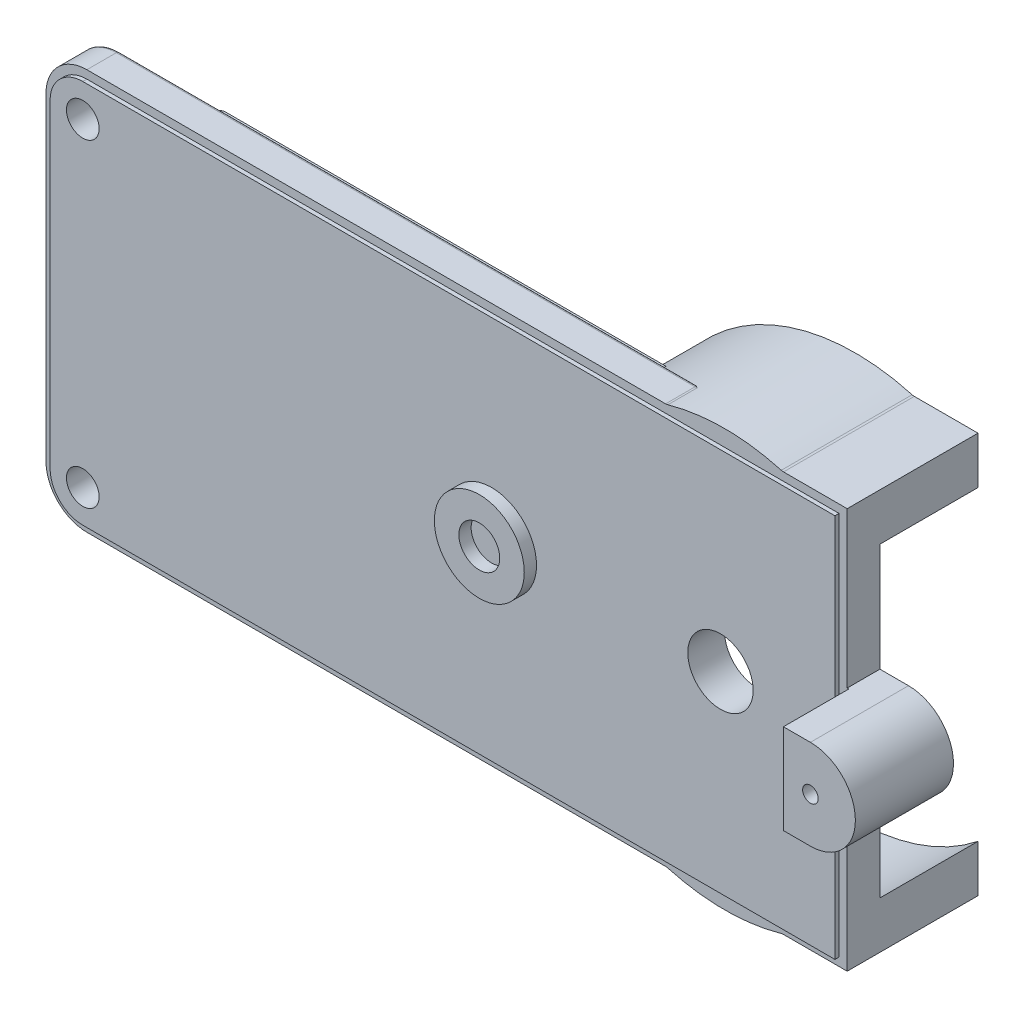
ISO-10303-21;
HEADER;
FILE_DESCRIPTION(('STEP AP214'),'2;1');
FILE_NAME('part.step','',(''),(''),'','','');
FILE_SCHEMA(('AUTOMOTIVE_DESIGN { 1 0 10303 214 1 1 1 1 }'));
ENDSEC;
DATA;
#1=APPLICATION_CONTEXT('core data for automotive mechanical design processes');
#2=APPLICATION_PROTOCOL_DEFINITION('international standard','automotive_design',2000,#1);
#3=PRODUCT_CONTEXT('',#1,'mechanical');
#4=PRODUCT('Part','Part','',(#3));
#5=PRODUCT_RELATED_PRODUCT_CATEGORY('part','',(#4));
#6=PRODUCT_DEFINITION_FORMATION('','',#4);
#7=PRODUCT_DEFINITION_CONTEXT('part definition',#1,'design');
#8=PRODUCT_DEFINITION('design','',#6,#7);
#9=PRODUCT_DEFINITION_SHAPE('','',#8);
#10=(LENGTH_UNIT() NAMED_UNIT(*) SI_UNIT(.MILLI.,.METRE.));
#11=(NAMED_UNIT(*) PLANE_ANGLE_UNIT() SI_UNIT($,.RADIAN.));
#12=(NAMED_UNIT(*) SI_UNIT($,.STERADIAN.) SOLID_ANGLE_UNIT());
#13=UNCERTAINTY_MEASURE_WITH_UNIT(LENGTH_MEASURE(1.E-05),#10,'distance_accuracy_value','');
#14=(GEOMETRIC_REPRESENTATION_CONTEXT(3) GLOBAL_UNCERTAINTY_ASSIGNED_CONTEXT((#13)) GLOBAL_UNIT_ASSIGNED_CONTEXT((#10,
#11,#12)) REPRESENTATION_CONTEXT('',''));
#15=CARTESIAN_POINT('',(0.,0.,0.));
#16=DIRECTION('',(0.,0.,1.));
#17=DIRECTION('',(1.,0.,0.));
#18=AXIS2_PLACEMENT_3D('',#15,#16,#17);
#19=CARTESIAN_POINT('',(-17.,-42.7531128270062,2.25));
#20=DIRECTION('',(0.,0.,1.));
#21=DIRECTION('',(1.,0.,0.));
#22=AXIS2_PLACEMENT_3D('',#19,#20,#21);
#23=PLANE('',#22);
#24=DIRECTION('',(0.,-1.,0.));
#25=VECTOR('',#24,1.);
#26=CARTESIAN_POINT('',(-41.,-42.7531128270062,2.25));
#27=LINE('',#26,#25);
#28=CARTESIAN_POINT('',(-41.,9.75,2.25));
#29=VERTEX_POINT('',#28);
#30=CARTESIAN_POINT('',(-41.,-9.74999999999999,2.25));
#31=VERTEX_POINT('',#30);
#32=EDGE_CURVE('E684',#29,#31,#27,.T.);
#33=ORIENTED_EDGE('',*,*,#32,.T.);
#34=CARTESIAN_POINT('',(-39.,-9.75,2.25));
#35=DIRECTION('',(0.,0.,1.));
#36=DIRECTION('',(1.,0.,0.));
#37=AXIS2_PLACEMENT_3D('',#34,#35,#36);
#38=CIRCLE('',#37,2.);
#39=CARTESIAN_POINT('',(-39.,-11.75,2.25));
#40=VERTEX_POINT('',#39);
#41=EDGE_CURVE('E686',#31,#40,#38,.T.);
#42=ORIENTED_EDGE('',*,*,#41,.T.);
#43=DIRECTION('',(1.,0.,0.));
#44=VECTOR('',#43,1.);
#45=CARTESIAN_POINT('',(-17.,-11.75,2.25));
#46=LINE('',#45,#44);
#47=CARTESIAN_POINT('',(7.,-11.75,2.25));
#48=VERTEX_POINT('',#47);
#49=EDGE_CURVE('E688',#40,#48,#46,.T.);
#50=ORIENTED_EDGE('',*,*,#49,.T.);
#51=DIRECTION('',(0.,1.,0.));
#52=VECTOR('',#51,1.);
#53=CARTESIAN_POINT('',(7.,-42.7531128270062,2.25));
#54=LINE('',#53,#52);
#55=CARTESIAN_POINT('',(7.,11.75,2.25));
#56=VERTEX_POINT('',#55);
#57=EDGE_CURVE('E690',#48,#56,#54,.T.);
#58=ORIENTED_EDGE('',*,*,#57,.T.);
#59=DIRECTION('',(-1.,0.,0.));
#60=VECTOR('',#59,1.);
#61=CARTESIAN_POINT('',(-17.,11.75,2.25));
#62=LINE('',#61,#60);
#63=CARTESIAN_POINT('',(-39.,11.75,2.25));
#64=VERTEX_POINT('',#63);
#65=EDGE_CURVE('E692',#56,#64,#62,.T.);
#66=ORIENTED_EDGE('',*,*,#65,.T.);
#67=CARTESIAN_POINT('',(-39.,9.75,2.25));
#68=DIRECTION('',(0.,0.,1.));
#69=DIRECTION('',(1.,0.,0.));
#70=AXIS2_PLACEMENT_3D('',#67,#68,#69);
#71=CIRCLE('',#70,2.);
#72=EDGE_CURVE('E694',#64,#29,#71,.T.);
#73=ORIENTED_EDGE('',*,*,#72,.T.);
#74=EDGE_LOOP('',(#33,#42,#50,#58,#66,#73));
#75=FACE_BOUND('',#74,.T.);
#76=CARTESIAN_POINT('',(-39.,9.75,2.25));
#77=DIRECTION('',(0.,0.,1.));
#78=DIRECTION('',(1.,0.,0.));
#79=AXIS2_PLACEMENT_3D('',#76,#77,#78);
#80=CIRCLE('',#79,0.999999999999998);
#81=CARTESIAN_POINT('',(-38.,9.75,2.25));
#82=VERTEX_POINT('',#81);
#83=EDGE_CURVE('E681',#82,#82,#80,.F.);
#84=ORIENTED_EDGE('',*,*,#83,.T.);
#85=EDGE_LOOP('',(#84));
#86=FACE_BOUND('',#85,.T.);
#87=CARTESIAN_POINT('',(0.,0.,2.25));
#88=DIRECTION('',(0.,0.,1.));
#89=DIRECTION('',(1.,0.,0.));
#90=AXIS2_PLACEMENT_3D('',#87,#88,#89);
#91=CIRCLE('',#90,2.);
#92=CARTESIAN_POINT('',(2.,0.,2.25));
#93=VERTEX_POINT('',#92);
#94=EDGE_CURVE('E678',#93,#93,#91,.T.);
#95=ORIENTED_EDGE('',*,*,#94,.F.);
#96=EDGE_LOOP('',(#95));
#97=FACE_BOUND('',#96,.T.);
#98=CARTESIAN_POINT('',(-39.,-9.75,2.25));
#99=DIRECTION('',(0.,0.,1.));
#100=DIRECTION('',(1.,0.,0.));
#101=AXIS2_PLACEMENT_3D('',#98,#99,#100);
#102=CIRCLE('',#101,0.999999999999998);
#103=CARTESIAN_POINT('',(-38.,-9.75,2.25));
#104=VERTEX_POINT('',#103);
#105=EDGE_CURVE('E675',#104,#104,#102,.F.);
#106=ORIENTED_EDGE('',*,*,#105,.T.);
#107=EDGE_LOOP('',(#106));
#108=FACE_BOUND('',#107,.T.);
#109=CARTESIAN_POINT('',(-14.,0.,2.25));
#110=DIRECTION('',(0.,0.,1.));
#111=DIRECTION('',(1.,0.,0.));
#112=AXIS2_PLACEMENT_3D('',#109,#110,#111);
#113=CIRCLE('',#112,2.75);
#114=CARTESIAN_POINT('',(-11.25,0.,2.25));
#115=VERTEX_POINT('',#114);
#116=EDGE_CURVE('E989',#115,#115,#113,.T.);
#117=ORIENTED_EDGE('',*,*,#116,.F.);
#118=EDGE_LOOP('',(#117));
#119=FACE_BOUND('',#118,.T.);
#120=ADVANCED_FACE('F33',(#75,#86,#97,#108,#119),#23,.T.);
#121=CARTESIAN_POINT('',(-41.5,-12.25,2.));
#122=DIRECTION('',(0.,1.,0.));
#123=DIRECTION('',(0.,0.,1.));
#124=AXIS2_PLACEMENT_3D('',#121,#122,#123);
#125=PLANE('',#124);
#126=DIRECTION('',(1.,0.,0.));
#127=VECTOR('',#126,1.);
#128=CARTESIAN_POINT('',(-41.5,-12.25,2.));
#129=LINE('',#128,#127);
#130=CARTESIAN_POINT('',(3.60555127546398,-12.25,2.));
#131=VERTEX_POINT('',#130);
#132=CARTESIAN_POINT('',(7.5,-12.25,2.));
#133=VERTEX_POINT('',#132);
#134=EDGE_CURVE('E461',#131,#133,#129,.T.);
#135=ORIENTED_EDGE('',*,*,#134,.F.);
#136=DIRECTION('',(0.,0.,1.));
#137=VECTOR('',#136,1.);
#138=CARTESIAN_POINT('',(3.60555127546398,-12.25,2.));
#139=LINE('',#138,#137);
#140=CARTESIAN_POINT('',(3.60555127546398,-12.25,-6.));
#141=VERTEX_POINT('',#140);
#142=EDGE_CURVE('E771',#131,#141,#139,.F.);
#143=ORIENTED_EDGE('',*,*,#142,.T.);
#144=DIRECTION('',(-1.,0.,0.));
#145=VECTOR('',#144,1.);
#146=CARTESIAN_POINT('',(-15.5900933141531,-12.25,-6.));
#147=LINE('',#146,#145);
#148=CARTESIAN_POINT('',(7.5,-12.25,-6.));
#149=VERTEX_POINT('',#148);
#150=EDGE_CURVE('E961',#149,#141,#147,.T.);
#151=ORIENTED_EDGE('',*,*,#150,.F.);
#152=DIRECTION('',(0.,0.,-1.));
#153=VECTOR('',#152,1.);
#154=CARTESIAN_POINT('',(7.5,-12.25,2.));
#155=LINE('',#154,#153);
#156=EDGE_CURVE('E475',#133,#149,#155,.T.);
#157=ORIENTED_EDGE('',*,*,#156,.F.);
#158=EDGE_LOOP('',(#135,#143,#151,#157));
#159=FACE_BOUND('',#158,.T.);
#160=ADVANCED_FACE('F523',(#159),#125,.F.);
#161=DIRECTION('',(0.,0.,-1.));
#162=VECTOR('',#161,1.);
#163=CARTESIAN_POINT('',(-39.,-12.25,2.));
#164=LINE('',#163,#162);
#165=CARTESIAN_POINT('',(-39.,-12.25,2.));
#166=VERTEX_POINT('',#165);
#167=CARTESIAN_POINT('',(-39.,-12.25,0.2));
#168=VERTEX_POINT('',#167);
#169=EDGE_CURVE('E435',#166,#168,#164,.T.);
#170=ORIENTED_EDGE('',*,*,#169,.T.);
#171=DIRECTION('',(1.,0.,0.));
#172=VECTOR('',#171,1.);
#173=CARTESIAN_POINT('',(-41.5,-12.25,0.2));
#174=LINE('',#173,#172);
#175=CARTESIAN_POINT('',(-3.60555127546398,-12.25,0.2));
#176=VERTEX_POINT('',#175);
#177=EDGE_CURVE('E804',#168,#176,#174,.T.);
#178=ORIENTED_EDGE('',*,*,#177,.T.);
#179=DIRECTION('',(0.,0.,1.));
#180=VECTOR('',#179,1.);
#181=CARTESIAN_POINT('',(-3.60555127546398,-12.25,2.));
#182=LINE('',#181,#180);
#183=CARTESIAN_POINT('',(-3.60555127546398,-12.25,2.));
#184=VERTEX_POINT('',#183);
#185=EDGE_CURVE('E769',#176,#184,#182,.T.);
#186=ORIENTED_EDGE('',*,*,#185,.T.);
#187=EDGE_CURVE('E462',#166,#184,#129,.T.);
#188=ORIENTED_EDGE('',*,*,#187,.F.);
#189=EDGE_LOOP('',(#170,#178,#186,#188));
#190=FACE_BOUND('',#189,.T.);
#191=ADVANCED_FACE('F530',(#190),#125,.F.);
#192=CARTESIAN_POINT('',(-41.5,12.25,2.));
#193=DIRECTION('',(0.,-1.,0.));
#194=DIRECTION('',(0.,0.,-1.));
#195=AXIS2_PLACEMENT_3D('',#192,#193,#194);
#196=PLANE('',#195);
#197=DIRECTION('',(0.,0.,1.));
#198=VECTOR('',#197,1.);
#199=CARTESIAN_POINT('',(-3.60555127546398,12.25,2.));
#200=LINE('',#199,#198);
#201=CARTESIAN_POINT('',(-3.60555127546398,12.25,2.));
#202=VERTEX_POINT('',#201);
#203=CARTESIAN_POINT('',(-3.60555127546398,12.25,0.2));
#204=VERTEX_POINT('',#203);
#205=EDGE_CURVE('E449',#202,#204,#200,.F.);
#206=ORIENTED_EDGE('',*,*,#205,.T.);
#207=DIRECTION('',(-1.,0.,0.));
#208=VECTOR('',#207,1.);
#209=CARTESIAN_POINT('',(-41.5,12.25,0.2));
#210=LINE('',#209,#208);
#211=CARTESIAN_POINT('',(-39.,12.25,0.2));
#212=VERTEX_POINT('',#211);
#213=EDGE_CURVE('E784',#204,#212,#210,.T.);
#214=ORIENTED_EDGE('',*,*,#213,.T.);
#215=DIRECTION('',(0.,0.,-1.));
#216=VECTOR('',#215,1.);
#217=CARTESIAN_POINT('',(-39.,12.25,2.));
#218=LINE('',#217,#216);
#219=CARTESIAN_POINT('',(-39.,12.25,2.));
#220=VERTEX_POINT('',#219);
#221=EDGE_CURVE('E447',#212,#220,#218,.F.);
#222=ORIENTED_EDGE('',*,*,#221,.T.);
#223=DIRECTION('',(-1.,0.,0.));
#224=VECTOR('',#223,1.);
#225=CARTESIAN_POINT('',(-41.5,12.25,2.));
#226=LINE('',#225,#224);
#227=EDGE_CURVE('E469',#202,#220,#226,.T.);
#228=ORIENTED_EDGE('',*,*,#227,.F.);
#229=EDGE_LOOP('',(#206,#214,#222,#228));
#230=FACE_BOUND('',#229,.T.);
#231=ADVANCED_FACE('F903',(#230),#196,.F.);
#232=DIRECTION('',(1.,0.,0.));
#233=VECTOR('',#232,1.);
#234=CARTESIAN_POINT('',(-15.5900933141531,12.25,-6.));
#235=LINE('',#234,#233);
#236=CARTESIAN_POINT('',(3.60555127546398,12.25,-6.));
#237=VERTEX_POINT('',#236);
#238=CARTESIAN_POINT('',(7.5,12.25,-6.));
#239=VERTEX_POINT('',#238);
#240=EDGE_CURVE('E418',#237,#239,#235,.T.);
#241=ORIENTED_EDGE('',*,*,#240,.F.);
#242=DIRECTION('',(0.,0.,1.));
#243=VECTOR('',#242,1.);
#244=CARTESIAN_POINT('',(3.60555127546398,12.25,2.));
#245=LINE('',#244,#243);
#246=CARTESIAN_POINT('',(3.60555127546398,12.25,2.));
#247=VERTEX_POINT('',#246);
#248=EDGE_CURVE('E746',#237,#247,#245,.T.);
#249=ORIENTED_EDGE('',*,*,#248,.T.);
#250=CARTESIAN_POINT('',(7.5,12.25,2.));
#251=VERTEX_POINT('',#250);
#252=EDGE_CURVE('E470',#251,#247,#226,.T.);
#253=ORIENTED_EDGE('',*,*,#252,.F.);
#254=DIRECTION('',(0.,0.,-1.));
#255=VECTOR('',#254,1.);
#256=CARTESIAN_POINT('',(7.5,12.25,2.));
#257=LINE('',#256,#255);
#258=EDGE_CURVE('E473',#251,#239,#257,.T.);
#259=ORIENTED_EDGE('',*,*,#258,.T.);
#260=EDGE_LOOP('',(#241,#249,#253,#259));
#261=FACE_BOUND('',#260,.T.);
#262=ADVANCED_FACE('F744',(#261),#196,.F.);
#263=CARTESIAN_POINT('',(-41.5,-12.25,2.));
#264=DIRECTION('',(0.,0.,1.));
#265=DIRECTION('',(1.,0.,0.));
#266=AXIS2_PLACEMENT_3D('',#263,#264,#265);
#267=PLANE('',#266);
#268=DIRECTION('',(0.,-1.,0.));
#269=VECTOR('',#268,1.);
#270=CARTESIAN_POINT('',(-41.5,12.25,2.));
#271=LINE('',#270,#269);
#272=CARTESIAN_POINT('',(-41.5,9.75,2.));
#273=VERTEX_POINT('',#272);
#274=CARTESIAN_POINT('',(-41.5,-9.75,2.));
#275=VERTEX_POINT('',#274);
#276=EDGE_CURVE('E457',#273,#275,#271,.T.);
#277=ORIENTED_EDGE('',*,*,#276,.T.);
#278=CARTESIAN_POINT('',(-39.,-9.75,2.));
#279=DIRECTION('',(0.,0.,1.));
#280=DIRECTION('',(1.,0.,0.));
#281=AXIS2_PLACEMENT_3D('',#278,#279,#280);
#282=CIRCLE('',#281,2.5);
#283=EDGE_CURVE('E445',#275,#166,#282,.T.);
#284=ORIENTED_EDGE('',*,*,#283,.T.);
#285=ORIENTED_EDGE('',*,*,#187,.T.);
#286=CARTESIAN_POINT('',(-3.60555127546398,-12.75,2.));
#287=DIRECTION('',(0.,0.,1.));
#288=DIRECTION('',(1.,0.,0.));
#289=AXIS2_PLACEMENT_3D('',#286,#287,#288);
#290=CIRCLE('',#289,0.5);
#291=CARTESIAN_POINT('',(-3.46949273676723,-12.2688679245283,2.));
#292=VERTEX_POINT('',#291);
#293=EDGE_CURVE('E775',#184,#292,#290,.F.);
#294=ORIENTED_EDGE('',*,*,#293,.T.);
#295=CARTESIAN_POINT('',(0.,0.,2.));
#296=DIRECTION('',(0.,0.,1.));
#297=DIRECTION('',(1.,0.,0.));
#298=AXIS2_PLACEMENT_3D('',#295,#296,#297);
#299=CIRCLE('',#298,12.75);
#300=CARTESIAN_POINT('',(3.46949273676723,-12.2688679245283,2.));
#301=VERTEX_POINT('',#300);
#302=EDGE_CURVE('E649',#292,#301,#299,.T.);
#303=ORIENTED_EDGE('',*,*,#302,.T.);
#304=CARTESIAN_POINT('',(3.60555127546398,-12.75,2.));
#305=DIRECTION('',(0.,0.,1.));
#306=DIRECTION('',(1.,0.,0.));
#307=AXIS2_PLACEMENT_3D('',#304,#305,#306);
#308=CIRCLE('',#307,0.5);
#309=EDGE_CURVE('E777',#301,#131,#308,.F.);
#310=ORIENTED_EDGE('',*,*,#309,.T.);
#311=ORIENTED_EDGE('',*,*,#134,.T.);
#312=DIRECTION('',(0.,1.,0.));
#313=VECTOR('',#312,1.);
#314=CARTESIAN_POINT('',(7.5,12.25,2.));
#315=LINE('',#314,#313);
#316=CARTESIAN_POINT('',(7.5,-2.75,2.));
#317=VERTEX_POINT('',#316);
#318=EDGE_CURVE('E466',#133,#317,#315,.T.);
#319=ORIENTED_EDGE('',*,*,#318,.T.);
#320=DIRECTION('',(-1.,0.,0.));
#321=VECTOR('',#320,1.);
#322=CARTESIAN_POINT('',(9.75,-2.75,2.));
#323=LINE('',#322,#321);
#324=CARTESIAN_POINT('',(7.6,-2.75,2.));
#325=VERTEX_POINT('',#324);
#326=EDGE_CURVE('E657',#325,#317,#323,.T.);
#327=ORIENTED_EDGE('',*,*,#326,.F.);
#328=DIRECTION('',(0.,-1.,0.));
#329=VECTOR('',#328,1.);
#330=CARTESIAN_POINT('',(7.6,-5.6688529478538,2.));
#331=LINE('',#330,#329);
#332=CARTESIAN_POINT('',(7.6,2.75,2.));
#333=VERTEX_POINT('',#332);
#334=EDGE_CURVE('E308',#333,#325,#331,.T.);
#335=ORIENTED_EDGE('',*,*,#334,.F.);
#336=DIRECTION('',(1.,0.,0.));
#337=VECTOR('',#336,1.);
#338=CARTESIAN_POINT('',(9.75,2.75,2.));
#339=LINE('',#338,#337);
#340=CARTESIAN_POINT('',(7.5,2.75,2.));
#341=VERTEX_POINT('',#340);
#342=EDGE_CURVE('E654',#341,#333,#339,.T.);
#343=ORIENTED_EDGE('',*,*,#342,.F.);
#344=EDGE_CURVE('E465',#341,#251,#315,.T.);
#345=ORIENTED_EDGE('',*,*,#344,.T.);
#346=ORIENTED_EDGE('',*,*,#252,.T.);
#347=CARTESIAN_POINT('',(3.60555127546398,12.75,2.));
#348=DIRECTION('',(0.,0.,1.));
#349=DIRECTION('',(1.,0.,0.));
#350=AXIS2_PLACEMENT_3D('',#347,#348,#349);
#351=CIRCLE('',#350,0.5);
#352=CARTESIAN_POINT('',(3.46949273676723,12.2688679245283,2.));
#353=VERTEX_POINT('',#352);
#354=EDGE_CURVE('E747',#247,#353,#351,.F.);
#355=ORIENTED_EDGE('',*,*,#354,.T.);
#356=CARTESIAN_POINT('',(0.,0.,2.));
#357=DIRECTION('',(0.,0.,1.));
#358=DIRECTION('',(1.,0.,0.));
#359=AXIS2_PLACEMENT_3D('',#356,#357,#358);
#360=CIRCLE('',#359,12.75);
#361=CARTESIAN_POINT('',(-3.46949273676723,12.2688679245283,2.));
#362=VERTEX_POINT('',#361);
#363=EDGE_CURVE('E321',#353,#362,#360,.T.);
#364=ORIENTED_EDGE('',*,*,#363,.T.);
#365=CARTESIAN_POINT('',(-3.60555127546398,12.75,2.));
#366=DIRECTION('',(0.,0.,1.));
#367=DIRECTION('',(1.,0.,0.));
#368=AXIS2_PLACEMENT_3D('',#365,#366,#367);
#369=CIRCLE('',#368,0.5);
#370=EDGE_CURVE('E753',#362,#202,#369,.F.);
#371=ORIENTED_EDGE('',*,*,#370,.T.);
#372=ORIENTED_EDGE('',*,*,#227,.T.);
#373=CARTESIAN_POINT('',(-39.,9.75,2.));
#374=DIRECTION('',(0.,0.,1.));
#375=DIRECTION('',(1.,0.,0.));
#376=AXIS2_PLACEMENT_3D('',#373,#374,#375);
#377=CIRCLE('',#376,2.5);
#378=EDGE_CURVE('E443',#220,#273,#377,.T.);
#379=ORIENTED_EDGE('',*,*,#378,.T.);
#380=EDGE_LOOP('',(#277,#284,#285,#294,#303,#310,#311,#319,#327,#335,#343,#345,#346,#355,#364,
#371,#372,#379));
#381=FACE_BOUND('',#380,.T.);
#382=CARTESIAN_POINT('',(-39.,-9.75,2.));
#383=DIRECTION('',(0.,0.,1.));
#384=DIRECTION('',(1.,0.,0.));
#385=AXIS2_PLACEMENT_3D('',#382,#383,#384);
#386=CIRCLE('',#385,2.);
#387=CARTESIAN_POINT('',(-41.,-9.74999999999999,2.));
#388=VERTEX_POINT('',#387);
#389=CARTESIAN_POINT('',(-39.,-11.75,2.));
#390=VERTEX_POINT('',#389);
#391=EDGE_CURVE('E664',#388,#390,#386,.T.);
#392=ORIENTED_EDGE('',*,*,#391,.F.);
#393=DIRECTION('',(0.,-1.,0.));
#394=VECTOR('',#393,1.);
#395=CARTESIAN_POINT('',(-41.,-42.7531128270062,2.));
#396=LINE('',#395,#394);
#397=CARTESIAN_POINT('',(-41.,9.75,2.));
#398=VERTEX_POINT('',#397);
#399=EDGE_CURVE('E661',#398,#388,#396,.T.);
#400=ORIENTED_EDGE('',*,*,#399,.F.);
#401=CARTESIAN_POINT('',(-39.,9.75,2.));
#402=DIRECTION('',(0.,0.,1.));
#403=DIRECTION('',(1.,0.,0.));
#404=AXIS2_PLACEMENT_3D('',#401,#402,#403);
#405=CIRCLE('',#404,2.);
#406=CARTESIAN_POINT('',(-39.,11.75,2.));
#407=VERTEX_POINT('',#406);
#408=EDGE_CURVE('E673',#407,#398,#405,.T.);
#409=ORIENTED_EDGE('',*,*,#408,.F.);
#410=DIRECTION('',(-1.,0.,0.));
#411=VECTOR('',#410,1.);
#412=CARTESIAN_POINT('',(-17.,11.75,2.));
#413=LINE('',#412,#411);
#414=CARTESIAN_POINT('',(7.,11.75,2.));
#415=VERTEX_POINT('',#414);
#416=EDGE_CURVE('E670',#415,#407,#413,.T.);
#417=ORIENTED_EDGE('',*,*,#416,.F.);
#418=DIRECTION('',(0.,1.,0.));
#419=VECTOR('',#418,1.);
#420=CARTESIAN_POINT('',(7.,-42.7531128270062,2.));
#421=LINE('',#420,#419);
#422=CARTESIAN_POINT('',(7.,-11.75,2.));
#423=VERTEX_POINT('',#422);
#424=EDGE_CURVE('E668',#423,#415,#421,.T.);
#425=ORIENTED_EDGE('',*,*,#424,.F.);
#426=DIRECTION('',(1.,0.,0.));
#427=VECTOR('',#426,1.);
#428=CARTESIAN_POINT('',(-17.,-11.75,2.));
#429=LINE('',#428,#427);
#430=EDGE_CURVE('E666',#390,#423,#429,.T.);
#431=ORIENTED_EDGE('',*,*,#430,.F.);
#432=EDGE_LOOP('',(#392,#400,#409,#417,#425,#431));
#433=FACE_BOUND('',#432,.T.);
#434=ADVANCED_FACE('F731',(#381,#433),#267,.T.);
#435=CARTESIAN_POINT('',(9.25,0.,6.));
#436=DIRECTION('',(0.,0.,-1.));
#437=DIRECTION('',(-1.,0.,0.));
#438=AXIS2_PLACEMENT_3D('',#435,#436,#437);
#439=CYLINDRICAL_SURFACE('',#438,2.75);
#440=CARTESIAN_POINT('',(9.25,0.,0.));
#441=DIRECTION('',(0.,0.,-1.));
#442=DIRECTION('',(-1.,0.,0.));
#443=AXIS2_PLACEMENT_3D('',#440,#441,#442);
#444=CIRCLE('',#443,2.75);
#445=CARTESIAN_POINT('',(9.24999999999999,2.75,0.));
#446=VERTEX_POINT('',#445);
#447=CARTESIAN_POINT('',(9.25000000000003,-2.75,0.));
#448=VERTEX_POINT('',#447);
#449=EDGE_CURVE('E340',#446,#448,#444,.T.);
#450=ORIENTED_EDGE('',*,*,#449,.F.);
#451=DIRECTION('',(0.,0.,1.));
#452=VECTOR('',#451,1.);
#453=CARTESIAN_POINT('',(9.24999999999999,2.75,-1.8594994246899));
#454=LINE('',#453,#452);
#455=CARTESIAN_POINT('',(9.24999999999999,2.75,6.));
#456=VERTEX_POINT('',#455);
#457=EDGE_CURVE('E719',#446,#456,#454,.T.);
#458=ORIENTED_EDGE('',*,*,#457,.T.);
#459=CARTESIAN_POINT('',(9.25,0.,6.));
#460=DIRECTION('',(0.,0.,-1.));
#461=DIRECTION('',(-1.,0.,0.));
#462=AXIS2_PLACEMENT_3D('',#459,#460,#461);
#463=CIRCLE('',#462,2.75);
#464=CARTESIAN_POINT('',(9.25,-2.75,6.));
#465=VERTEX_POINT('',#464);
#466=EDGE_CURVE('E342',#456,#465,#463,.T.);
#467=ORIENTED_EDGE('',*,*,#466,.T.);
#468=DIRECTION('',(0.,0.,1.));
#469=VECTOR('',#468,1.);
#470=CARTESIAN_POINT('',(9.25000000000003,-2.75,-1.8594994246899));
#471=LINE('',#470,#469);
#472=EDGE_CURVE('E327',#448,#465,#471,.T.);
#473=ORIENTED_EDGE('',*,*,#472,.F.);
#474=EDGE_LOOP('',(#450,#458,#467,#473));
#475=FACE_BOUND('',#474,.T.);
#476=ADVANCED_FACE('F725',(#475),#439,.T.);
#477=CARTESIAN_POINT('',(7.5,12.25,2.));
#478=DIRECTION('',(-1.,0.,0.));
#479=DIRECTION('',(0.,0.,1.));
#480=AXIS2_PLACEMENT_3D('',#477,#478,#479);
#481=PLANE('',#480);
#482=ORIENTED_EDGE('',*,*,#344,.F.);
#483=DIRECTION('',(0.,0.,1.));
#484=VECTOR('',#483,1.);
#485=CARTESIAN_POINT('',(7.5,2.75,-1.8594994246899));
#486=LINE('',#485,#484);
#487=CARTESIAN_POINT('',(7.5,2.75,0.));
#488=VERTEX_POINT('',#487);
#489=EDGE_CURVE('E334',#488,#341,#486,.T.);
#490=ORIENTED_EDGE('',*,*,#489,.F.);
#491=DIRECTION('',(0.,1.,0.));
#492=VECTOR('',#491,1.);
#493=CARTESIAN_POINT('',(7.5,12.25,0.));
#494=LINE('',#493,#492);
#495=CARTESIAN_POINT('',(7.5,9.3674969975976,0.));
#496=VERTEX_POINT('',#495);
#497=EDGE_CURVE('E450',#488,#496,#494,.T.);
#498=ORIENTED_EDGE('',*,*,#497,.T.);
#499=DIRECTION('',(0.,0.,1.));
#500=VECTOR('',#499,1.);
#501=CARTESIAN_POINT('',(7.5,9.3674969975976,-6.));
#502=LINE('',#501,#500);
#503=CARTESIAN_POINT('',(7.5,9.3674969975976,-6.));
#504=VERTEX_POINT('',#503);
#505=EDGE_CURVE('E417',#504,#496,#502,.T.);
#506=ORIENTED_EDGE('',*,*,#505,.F.);
#507=DIRECTION('',(0.,-1.,0.));
#508=VECTOR('',#507,1.);
#509=CARTESIAN_POINT('',(7.5,-44.9464128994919,-6.));
#510=LINE('',#509,#508);
#511=EDGE_CURVE('E410',#239,#504,#510,.T.);
#512=ORIENTED_EDGE('',*,*,#511,.F.);
#513=ORIENTED_EDGE('',*,*,#258,.F.);
#514=EDGE_LOOP('',(#482,#490,#498,#506,#512,#513));
#515=FACE_BOUND('',#514,.T.);
#516=ADVANCED_FACE('F735',(#515),#481,.F.);
#517=CARTESIAN_POINT('',(0.,0.,-6.));
#518=DIRECTION('',(0.,0.,1.));
#519=DIRECTION('',(1.,0.,0.));
#520=AXIS2_PLACEMENT_3D('',#517,#518,#519);
#521=CYLINDRICAL_SURFACE('',#520,12.75);
#522=DIRECTION('',(0.,0.,1.));
#523=VECTOR('',#522,1.);
#524=CARTESIAN_POINT('',(-3.46949273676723,-12.2688679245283,-6.));
#525=LINE('',#524,#523);
#526=CARTESIAN_POINT('',(-3.46949273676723,-12.2688679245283,0.2));
#527=VERTEX_POINT('',#526);
#528=EDGE_CURVE('E762',#292,#527,#525,.F.);
#529=ORIENTED_EDGE('',*,*,#528,.T.);
#530=CARTESIAN_POINT('',(-3.75387638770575,-12.2433641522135,0.0981070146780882));
#531=CARTESIAN_POINT('',(-3.70036907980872,-12.2013410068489,0.055381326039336));
#532=CARTESIAN_POINT('',(-3.64829361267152,-12.2168921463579,-0.00378597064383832));
#533=CARTESIAN_POINT('',(-3.7306826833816,-12.2417147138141,0.106511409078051));
#534=CARTESIAN_POINT('',(-3.68007258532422,-12.207482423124,0.0656893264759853));
#535=CARTESIAN_POINT('',(-3.63102815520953,-12.2220471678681,0.0130228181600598));
#536=CARTESIAN_POINT('',(-3.70653310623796,-12.2407102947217,0.115200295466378));
#537=CARTESIAN_POINT('',(-3.65937519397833,-12.2136861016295,0.0771715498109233));
#538=CARTESIAN_POINT('',(-3.61427449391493,-12.2270112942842,0.0304005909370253));
#539=CARTESIAN_POINT('',(-3.65690515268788,-12.2406847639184,0.13297585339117));
#540=CARTESIAN_POINT('',(-3.61811463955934,-12.2259401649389,0.101494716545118));
#541=CARTESIAN_POINT('',(-3.58155205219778,-12.2366368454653,0.0659517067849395));
#542=CARTESIAN_POINT('',(-3.63142829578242,-12.2416614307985,0.14206206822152));
#543=CARTESIAN_POINT('',(-3.59744795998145,-12.2320235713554,0.114367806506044));
#544=CARTESIAN_POINT('',(-3.56558241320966,-12.24129860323,0.0841241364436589));
#545=CARTESIAN_POINT('',(-3.58377434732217,-12.2459182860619,0.159021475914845));
#546=CARTESIAN_POINT('',(-3.55948896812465,-12.2430962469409,0.138915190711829));
#547=CARTESIAN_POINT('',(-3.53664177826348,-12.2496878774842,0.118042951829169));
#548=CARTESIAN_POINT('',(-3.56171401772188,-12.2488089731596,0.166858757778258));
#549=CARTESIAN_POINT('',(-3.5421238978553,-12.2481237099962,0.150484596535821));
#550=CARTESIAN_POINT('',(-3.52359657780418,-12.2534463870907,0.133717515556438));
#551=CARTESIAN_POINT('',(-3.51756776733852,-12.2566864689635,0.182623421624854));
#552=CARTESIAN_POINT('',(-3.50749296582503,-12.2580748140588,0.173908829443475));
#553=CARTESIAN_POINT('',(-3.49768653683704,-12.2608674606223,0.165246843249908));
#554=CARTESIAN_POINT('',(-3.49548184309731,-12.2616736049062,0.19055081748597));
#555=CARTESIAN_POINT('',(-3.49013407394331,-12.2630256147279,0.185824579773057));
#556=CARTESIAN_POINT('',(-3.48482172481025,-12.264530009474,0.181101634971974));
#557=CARTESIAN_POINT('',(-3.47297184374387,-12.2678930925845,0.198733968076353));
#558=CARTESIAN_POINT('',(-3.47225797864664,-12.26808564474,0.198100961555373));
#559=CARTESIAN_POINT('',(-3.47154655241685,-12.2682869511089,0.197467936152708));
#560=CARTESIAN_POINT('',(-3.47227561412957,-12.2680865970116,0.19898717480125));
#561=CARTESIAN_POINT('',(-3.47170493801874,-12.2682421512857,0.198480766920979));
#562=CARTESIAN_POINT('',(-3.471135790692,-12.2684031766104,0.197974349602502));
#563=CARTESIAN_POINT('',(-3.47088373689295,-12.2684756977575,0.199493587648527));
#564=CARTESIAN_POINT('',(-3.47059884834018,-12.268555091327,0.199240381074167));
#565=CARTESIAN_POINT('',(-3.47031426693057,-12.2686355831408,0.198987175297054));
#566=CARTESIAN_POINT('',(-3.47018808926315,-12.2686712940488,0.199746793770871));
#567=CARTESIAN_POINT('',(-3.47004579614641,-12.2687115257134,0.199620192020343));
#568=CARTESIAN_POINT('',(-3.46990350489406,-12.2687517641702,0.199493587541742));
#569=CARTESIAN_POINT('',(-3.46949273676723,-12.2688679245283,0.2));
#570=CARTESIAN_POINT('',(-3.46949273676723,-12.2688679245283,0.2));
#571=CARTESIAN_POINT('',(-3.46949273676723,-12.2688679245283,0.2));
#572=(BOUNDED_SURFACE() B_SPLINE_SURFACE(3,2,((#530,#531,#532),(#533,#534,#535),(#536,#537,
#538),(#539,#540,#541),(#542,#543,#544),(#545,#546,#547),(#548,#549,#550),(#551,#552,#553),
(#554,#555,#556),(#557,#558,#559),(#560,#561,#562),(#563,#564,#565),(#566,#567,#568),(#569,#570,
#571)),.UNSPECIFIED.,.F.,.F.,.F.) B_SPLINE_SURFACE_WITH_KNOTS((4,2,2,2,2,2,4),(3,3),(0.,
0.0745022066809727,0.148920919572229,0.21154833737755,0.274185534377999,0.27618554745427,
0.278185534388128),(0.,1.),
.UNSPECIFIED.) GEOMETRIC_REPRESENTATION_ITEM() RATIONAL_B_SPLINE_SURFACE(((1.,0.92793227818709,
1.),(1.,0.939189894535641,1.),(1.,0.949678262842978,1.),(1.,0.968232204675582,1.),(1.,
0.976300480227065,1.),(1.,0.988140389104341,1.),(1.,0.992390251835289,1.),(1.,0.998222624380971,
1.),(1.,0.999804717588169,1.),(1.,0.999988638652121,1.),(1.,0.999992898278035,1.),(1.,
0.99999857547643,1.),(1.,0.999999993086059,1.),(1.,1.,1.))) REPRESENTATION_ITEM('') SURFACE());
#573=CARTESIAN_POINT('',(-3.64829361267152,-12.2168921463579,-0.00378597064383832));
#574=CARTESIAN_POINT('',(-3.63102815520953,-12.2220471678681,0.0130228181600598));
#575=CARTESIAN_POINT('',(-3.61427449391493,-12.2270112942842,0.0304005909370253));
#576=CARTESIAN_POINT('',(-3.58155205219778,-12.2366368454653,0.0659517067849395));
#577=CARTESIAN_POINT('',(-3.56558241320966,-12.24129860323,0.0841241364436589));
#578=CARTESIAN_POINT('',(-3.53664177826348,-12.2496878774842,0.118042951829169));
#579=CARTESIAN_POINT('',(-3.52359657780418,-12.2534463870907,0.133717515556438));
#580=CARTESIAN_POINT('',(-3.49768653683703,-12.2608674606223,0.165246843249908));
#581=CARTESIAN_POINT('',(-3.48482172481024,-12.264530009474,0.181101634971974));
#582=CARTESIAN_POINT('',(-3.47154655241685,-12.2682869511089,0.197467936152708));
#583=CARTESIAN_POINT('',(-3.471135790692,-12.2684031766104,0.197974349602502));
#584=CARTESIAN_POINT('',(-3.47031426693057,-12.2686355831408,0.198987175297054));
#585=CARTESIAN_POINT('',(-3.46990350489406,-12.2687517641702,0.199493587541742));
#586=CARTESIAN_POINT('',(-3.46949273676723,-12.2688679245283,0.2));
#587=B_SPLINE_CURVE_WITH_KNOTS('',3,(#573,#574,#575,#576,#577,#578,#579,#580,#581,#582,#583,
#584,#585,#586),.UNSPECIFIED.,.F.,.F.,(4,2,2,2,2,2,4),(0.,0.0745022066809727,0.148920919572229,
0.21154833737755,0.274185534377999,0.27618554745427,0.278185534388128),.UNSPECIFIED.);
#588=CARTESIAN_POINT('',(-3.54986708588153,-12.245854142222,0.102542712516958));
#589=VERTEX_POINT('',#588);
#590=EDGE_CURVE('E864',#527,#589,#587,.F.);
#591=ORIENTED_EDGE('',*,*,#590,.T.);
#592=CARTESIAN_POINT('',(-5.2502330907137,-11.9439853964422,0.030409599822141));
#593=CARTESIAN_POINT('',(-5.19726330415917,-11.858109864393,0.0840922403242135));
#594=CARTESIAN_POINT('',(-5.17037246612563,-11.7623191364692,0.0278494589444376));
#595=CARTESIAN_POINT('',(-5.14348162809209,-11.6665284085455,-0.0283933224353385));
#596=CARTESIAN_POINT('',(-5.16914840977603,-11.6551449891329,-0.139180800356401));
#597=CARTESIAN_POINT('',(-5.20932372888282,-11.9530584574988,0.0247700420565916));
#598=CARTESIAN_POINT('',(-5.15977090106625,-11.8658228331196,0.0729385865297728));
#599=CARTESIAN_POINT('',(-5.13319860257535,-11.7742712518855,0.0155140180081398));
#600=CARTESIAN_POINT('',(-5.10711419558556,-11.6825576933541,-0.0417738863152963));
#601=CARTESIAN_POINT('',(-5.12887085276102,-11.6730108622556,-0.15045991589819));
#602=CARTESIAN_POINT('',(-5.16792594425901,-11.9621105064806,0.020087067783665));
#603=CARTESIAN_POINT('',(-5.12103137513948,-11.8743097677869,0.0628896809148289));
#604=CARTESIAN_POINT('',(-5.09500644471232,-11.786707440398,0.00467264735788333));
#605=CARTESIAN_POINT('',(-5.06943253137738,-11.6989561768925,-0.0534406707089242));
#606=CARTESIAN_POINT('',(-5.08811241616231,-11.6908353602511,-0.159825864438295));
#607=CARTESIAN_POINT('',(-5.08448395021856,-11.9800937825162,0.0123527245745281));
#608=CARTESIAN_POINT('',(-5.04222940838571,-11.8922701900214,0.0450053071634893));
#609=CARTESIAN_POINT('',(-5.01720232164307,-11.8121713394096,-0.0143359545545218));
#610=CARTESIAN_POINT('',(-4.99262159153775,-11.7319277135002,-0.0735617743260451));
#611=CARTESIAN_POINT('',(-5.00595910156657,-11.7262464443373,-0.175294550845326));
#612=CARTESIAN_POINT('',(-5.04244071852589,-11.9890251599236,0.00929909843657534));
#613=CARTESIAN_POINT('',(-5.00213265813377,-11.9017427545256,0.0371299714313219));
#614=CARTESIAN_POINT('',(-4.97759240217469,-11.8251982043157,-0.0225068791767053));
#615=CARTESIAN_POINT('',(-4.95346089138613,-11.7485199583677,-0.0820701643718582));
#616=CARTESIAN_POINT('',(-4.96456518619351,-11.7438333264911,-0.181401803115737));
#617=CARTESIAN_POINT('',(-4.95773867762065,-12.0067524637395,0.00451740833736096));
#618=CARTESIAN_POINT('',(-4.92093761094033,-11.9213004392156,0.023346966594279));
#619=CARTESIAN_POINT('',(-4.89728830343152,-11.8515594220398,-0.0365516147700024));
#620=CARTESIAN_POINT('',(-4.87404688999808,-11.7816840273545,-0.0963809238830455));
#621=CARTESIAN_POINT('',(-4.88117128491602,-11.7787403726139,-0.190965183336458));
#622=CARTESIAN_POINT('',(-4.91507798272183,-12.0155476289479,0.00279518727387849));
#623=CARTESIAN_POINT('',(-4.87979933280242,-11.9313930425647,0.0174201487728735));
#624=CARTESIAN_POINT('',(-4.85659014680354,-11.8648948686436,-0.0424152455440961));
#625=CARTESIAN_POINT('',(-4.83375513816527,-11.7982746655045,-0.102207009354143));
#626=CARTESIAN_POINT('',(-4.83916944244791,-11.7960590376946,-0.194409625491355));
#627=CARTESIAN_POINT('',(-4.82944778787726,-12.0329337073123,0.000536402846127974));
#628=CARTESIAN_POINT('',(-4.79693831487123,-11.9519174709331,0.00739697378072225));
#629=CARTESIAN_POINT('',(-4.77453900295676,-11.891635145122,-0.0520347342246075));
#630=CARTESIAN_POINT('',(-4.7525106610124,-11.8312320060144,-0.111422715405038));
#631=CARTESIAN_POINT('',(-4.75486172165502,-11.8302941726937,-0.19892719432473));
#632=CARTESIAN_POINT('',(-4.78647815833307,-12.0415245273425,3.70194738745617E-07));
#633=CARTESIAN_POINT('',(-4.75518412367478,-11.9623554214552,0.00328053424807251));
#634=CARTESIAN_POINT('',(-4.73318573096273,-11.9050400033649,-0.0557896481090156));
#635=CARTESIAN_POINT('',(-4.71152785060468,-11.8476151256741,-0.114837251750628));
#636=CARTESIAN_POINT('',(-4.7125557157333,-11.8472104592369,-0.199999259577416));
#637=CARTESIAN_POINT('',(-4.68054157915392,-12.062375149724,-5.40526234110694E-07));
#638=CARTESIAN_POINT('',(-4.6521982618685,-11.9881784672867,-0.00474211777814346));
#639=CARTESIAN_POINT('',(-4.63091871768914,-11.9379247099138,-0.0626508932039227));
#640=CARTESIAN_POINT('',(-4.61035922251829,-11.8874393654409,-0.120510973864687));
#641=CARTESIAN_POINT('',(-4.60825522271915,-11.8882676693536,-0.200001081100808));
#642=CARTESIAN_POINT('',(-4.61747044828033,-12.0745043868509,0.00114091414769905));
#643=CARTESIAN_POINT('',(-4.59049015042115,-12.0037175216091,-0.00774392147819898));
#644=CARTESIAN_POINT('',(-4.56975960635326,-11.9573618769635,-0.0646638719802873));
#645=CARTESIAN_POINT('',(-4.54966764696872,-11.9108064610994,-0.121581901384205));
#646=CARTESIAN_POINT('',(-4.54615816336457,-11.9121514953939,-0.197718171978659));
#647=CARTESIAN_POINT('',(-4.4912110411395,-12.0982213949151,0.00552594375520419));
#648=CARTESIAN_POINT('',(-4.46673014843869,-12.0347499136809,-0.0103698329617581));
#649=CARTESIAN_POINT('',(-4.44696785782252,-11.9957885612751,-0.0648944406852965));
#650=CARTESIAN_POINT('',(-4.42783665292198,-11.9566296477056,-0.119418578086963));
#651=CARTESIAN_POINT('',(-4.42184870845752,-11.9588529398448,-0.188948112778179));
#652=CARTESIAN_POINT('',(-4.42802275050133,-12.1098090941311,0.00876979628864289));
#653=CARTESIAN_POINT('',(-4.40460531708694,-12.0502628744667,-0.010029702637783));
#654=CARTESIAN_POINT('',(-4.38533515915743,-12.0147780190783,-0.0631115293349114));
#655=CARTESIAN_POINT('',(-4.36662653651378,-11.9791232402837,-0.116226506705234));
#656=CARTESIAN_POINT('',(-4.35963629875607,-11.9816704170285,-0.182460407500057));
#657=CARTESIAN_POINT('',(-4.30196758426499,-12.1323735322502,0.0173530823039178));
#658=CARTESIAN_POINT('',(-4.28052688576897,-12.0809455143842,-0.00601544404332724));
#659=CARTESIAN_POINT('',(-4.26213229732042,-12.0520610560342,-0.0558041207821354));
#660=CARTESIAN_POINT('',(-4.24429116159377,-12.0230091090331,-0.105625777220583));
#661=CARTESIAN_POINT('',(-4.23552793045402,-12.0261023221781,-0.16529383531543));
#662=CARTESIAN_POINT('',(-4.23910030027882,-12.1433517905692,0.0226870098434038));
#663=CARTESIAN_POINT('',(-4.2185114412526,-12.0961339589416,-0.0023778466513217));
#664=CARTESIAN_POINT('',(-4.20056239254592,-12.0703563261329,-0.0502894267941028));
#665=CARTESIAN_POINT('',(-4.18310589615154,-12.0444352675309,-0.0982606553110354));
#666=CARTESIAN_POINT('',(-4.17363156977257,-12.0477197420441,-0.154625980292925));
#667=CARTESIAN_POINT('',(-4.11392446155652,-12.1646759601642,0.0356633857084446));
#668=CARTESIAN_POINT('',(-4.09494059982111,-12.1259891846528,0.00845089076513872));
#669=CARTESIAN_POINT('',(-4.07778932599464,-12.1061192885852,-0.0352487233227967));
#670=CARTESIAN_POINT('',(-4.06112387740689,-12.0861078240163,-0.0790085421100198));
#671=CARTESIAN_POINT('',(-4.05038894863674,-12.0897094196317,-0.12867322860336));
#672=CARTESIAN_POINT('',(-4.05161542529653,-12.1750224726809,0.0433035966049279));
#673=CARTESIAN_POINT('',(-4.03332785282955,-12.1406734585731,0.0156152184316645));
#674=CARTESIAN_POINT('',(-4.01658586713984,-12.1235877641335,-0.0257265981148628));
#675=CARTESIAN_POINT('',(-4.00027109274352,-12.106382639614,-0.0671533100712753));
#676=CARTESIAN_POINT('',(-3.98904221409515,-12.1100828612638,-0.113392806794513));
#677=CARTESIAN_POINT('',(-3.94814015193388,-12.1917784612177,0.0586410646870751));
#678=CARTESIAN_POINT('',(-3.93085123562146,-12.1647023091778,0.0313468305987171));
#679=CARTESIAN_POINT('',(-3.91483550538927,-12.1520196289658,-0.00553351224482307));
#680=CARTESIAN_POINT('',(-3.89901535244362,-12.1392823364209,-0.0424525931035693));
#681=CARTESIAN_POINT('',(-3.88716501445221,-12.1430772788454,-0.082717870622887));
#682=CARTESIAN_POINT('',(-3.90662349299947,-12.1983833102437,0.0655285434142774));
#683=CARTESIAN_POINT('',(-3.88974743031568,-12.1742325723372,0.0386993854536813));
#684=CARTESIAN_POINT('',(-3.8739801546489,-12.163267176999,0.00378134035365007));
#685=CARTESIAN_POINT('',(-3.85838946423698,-12.1522539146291,-0.0311836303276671));
#686=CARTESIAN_POINT('',(-3.84628953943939,-12.1560829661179,-0.0689429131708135));
#687=CARTESIAN_POINT('',(-3.82450720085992,-12.2112244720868,0.0812066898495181));
#688=CARTESIAN_POINT('',(-3.80842633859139,-12.192863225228,0.0560780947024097));
#689=CARTESIAN_POINT('',(-3.79312224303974,-12.1851991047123,0.0255027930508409));
#690=CARTESIAN_POINT('',(-3.77799392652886,-12.1774872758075,-0.00512024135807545));
#691=CARTESIAN_POINT('',(-3.76544145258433,-12.1813686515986,-0.0375866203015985));
#692=CARTESIAN_POINT('',(-3.78391271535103,-12.2174589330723,0.0900060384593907));
#693=CARTESIAN_POINT('',(-3.76819258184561,-12.2019673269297,0.066108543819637));
#694=CARTESIAN_POINT('',(-3.75312451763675,-12.1958806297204,0.0379235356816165));
#695=CARTESIAN_POINT('',(-3.73820798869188,-12.1897540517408,0.00968049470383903));
#696=CARTESIAN_POINT('',(-3.72547390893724,-12.1936450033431,-0.0199879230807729));
#697=CARTESIAN_POINT('',(-3.71910911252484,-12.2272463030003,0.107027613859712));
#698=CARTESIAN_POINT('',(-3.70391477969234,-12.2163337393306,0.0860687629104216));
#699=CARTESIAN_POINT('',(-3.68924180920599,-12.2126907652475,0.0623837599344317));
#700=CARTESIAN_POINT('',(-3.67463234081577,-12.2090310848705,0.0386744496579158));
#701=CARTESIAN_POINT('',(-3.66167113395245,-12.2129174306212,0.0140552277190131));
#702=CARTESIAN_POINT('',(-3.69413264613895,-12.230974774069,0.114376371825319));
#703=CARTESIAN_POINT('',(-3.67914586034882,-12.2218227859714,0.0947956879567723));
#704=CARTESIAN_POINT('',(-3.66461185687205,-12.2191056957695,0.0730388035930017));
#705=CARTESIAN_POINT('',(-3.65013049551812,-12.2163750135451,0.0512541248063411));
#706=CARTESIAN_POINT('',(-3.63708040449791,-12.2202592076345,0.028752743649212));
#707=CARTESIAN_POINT('',(-3.65869156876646,-12.236212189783,0.126892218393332));
#708=CARTESIAN_POINT('',(-3.64397968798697,-12.2295565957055,0.109874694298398));
#709=CARTESIAN_POINT('',(-3.62965304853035,-12.2281291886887,0.0913508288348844));
#710=CARTESIAN_POINT('',(-3.61533949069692,-12.2266984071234,0.0728202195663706));
#711=CARTESIAN_POINT('',(-3.60218667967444,-12.2305722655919,0.0537844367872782));
#712=CARTESIAN_POINT('',(-3.64726472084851,-12.2378916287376,0.131288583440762));
#713=CARTESIAN_POINT('',(-3.63264556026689,-12.2320389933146,0.115197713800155));
#714=CARTESIAN_POINT('',(-3.6183800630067,-12.2310248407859,0.0978069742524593));
#715=CARTESIAN_POINT('',(-3.60412558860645,-12.2300078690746,0.0804091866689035));
#716=CARTESIAN_POINT('',(-3.59093630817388,-12.2338792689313,0.0625771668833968));
#717=CARTESIAN_POINT('',(-3.62545735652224,-12.2410817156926,0.140730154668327));
#718=CARTESIAN_POINT('',(-3.61101505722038,-12.2367595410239,0.126693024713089));
#719=CARTESIAN_POINT('',(-3.59686377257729,-12.2365285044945,0.111723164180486));
#720=CARTESIAN_POINT('',(-3.58272342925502,-12.2362946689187,0.0967461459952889));
#721=CARTESIAN_POINT('',(-3.56946573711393,-12.2401609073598,0.0814603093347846));
#722=CARTESIAN_POINT('',(-3.61507553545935,-12.2425925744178,0.145774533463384));
#723=CARTESIAN_POINT('',(-3.60071514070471,-12.2389985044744,0.132864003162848));
#724=CARTESIAN_POINT('',(-3.58661918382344,-12.239136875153,0.119181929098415));
#725=CARTESIAN_POINT('',(-3.57253167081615,-12.2392731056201,0.105492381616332));
#726=CARTESIAN_POINT('',(-3.55924425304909,-12.2431359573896,0.0915490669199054));
#727=CARTESIAN_POINT('',(-3.59461983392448,-12.2455573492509,0.157580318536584));
#728=CARTESIAN_POINT('',(-3.58042281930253,-12.243395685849,0.147374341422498));
#729=CARTESIAN_POINT('',(-3.56643188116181,-12.2442579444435,0.136693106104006));
#730=CARTESIAN_POINT('',(-3.55245157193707,-12.2451175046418,0.126002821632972));
#731=CARTESIAN_POINT('',(-3.53910446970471,-12.2489739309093,0.115160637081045));
#732=CARTESIAN_POINT('',(-3.58481807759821,-12.2469698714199,0.16448529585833));
#733=CARTESIAN_POINT('',(-3.57069480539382,-12.2454943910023,0.155900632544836));
#734=CARTESIAN_POINT('',(-3.55675739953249,-12.2466995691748,0.146965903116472));
#735=CARTESIAN_POINT('',(-3.54282471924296,-12.2479035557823,0.138023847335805));
#736=CARTESIAN_POINT('',(-3.52945409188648,-12.2517553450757,0.128970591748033));
#737=CARTESIAN_POINT('',(-3.57432626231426,-12.2484777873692,0.175171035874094));
#738=CARTESIAN_POINT('',(-3.56028268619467,-12.2477359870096,0.169144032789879));
#739=CARTESIAN_POINT('',(-3.54640117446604,-12.249306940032,0.162901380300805));
#740=CARTESIAN_POINT('',(-3.53252059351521,-12.2508776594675,0.156657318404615));
#741=CARTESIAN_POINT('',(-3.5191243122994,-12.2547246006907,0.150342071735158));
#742=CARTESIAN_POINT('',(-3.57165951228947,-12.2488604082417,0.178417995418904));
#743=CARTESIAN_POINT('',(-3.55763634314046,-12.2483049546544,0.17317285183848));
#744=CARTESIAN_POINT('',(-3.54376878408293,-12.2499686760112,0.167747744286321));
#745=CARTESIAN_POINT('',(-3.52990165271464,-12.2516322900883,0.162321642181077));
#746=CARTESIAN_POINT('',(-3.51649874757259,-12.2554780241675,0.156835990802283));
#747=CARTESIAN_POINT('',(-3.56739374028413,-12.2494719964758,0.18509508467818));
#748=CARTESIAN_POINT('',(-3.55340353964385,-12.2492144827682,0.181465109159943));
#749=CARTESIAN_POINT('',(-3.53955790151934,-12.251026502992,0.177720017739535));
#750=CARTESIAN_POINT('',(-3.5257126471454,-12.2528384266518,0.173973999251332));
#751=CARTESIAN_POINT('',(-3.51229885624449,-12.2566823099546,0.170190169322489));
#752=CARTESIAN_POINT('',(-3.5657924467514,-12.2497012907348,0.188524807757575));
#753=CARTESIAN_POINT('',(-3.55181441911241,-12.2495556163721,0.185728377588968));
#754=CARTESIAN_POINT('',(-3.53797716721,-12.2514231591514,0.182845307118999));
#755=CARTESIAN_POINT('',(-3.52413994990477,-12.2532906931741,0.179961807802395));
#756=CARTESIAN_POINT('',(-3.51072229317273,-12.2571338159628,0.177049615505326));
#757=CARTESIAN_POINT('',(-3.56385094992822,-12.2499792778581,0.195492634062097));
#758=CARTESIAN_POINT('',(-3.5498879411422,-12.2499691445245,0.194392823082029));
#759=CARTESIAN_POINT('',(-3.53606059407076,-12.2519040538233,0.193260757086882));
#760=CARTESIAN_POINT('',(-3.52223338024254,-12.2538389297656,0.192128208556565));
#761=CARTESIAN_POINT('',(-3.50881078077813,-12.2576812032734,0.190985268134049));
#762=CARTESIAN_POINT('',(-3.56351470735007,-12.250027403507,0.199031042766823));
#763=CARTESIAN_POINT('',(-3.54955429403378,-12.2500407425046,0.198794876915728));
#764=CARTESIAN_POINT('',(-3.53572866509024,-12.2519873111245,0.198551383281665));
#765=CARTESIAN_POINT('',(-3.52190317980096,-12.2539338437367,0.198308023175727));
#766=CARTESIAN_POINT('',(-3.50847973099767,-12.2577759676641,0.198062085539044));
#767=CARTESIAN_POINT('',(-3.56412833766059,-12.2499395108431,0.206114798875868));
#768=CARTESIAN_POINT('',(-3.55016305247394,-12.2499100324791,0.207606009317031));
#769=CARTESIAN_POINT('',(-3.53633441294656,-12.2518352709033,0.209142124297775));
#770=CARTESIAN_POINT('',(-3.52250564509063,-12.2537605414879,0.21067839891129));
#771=CARTESIAN_POINT('',(-3.50908388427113,-12.2576028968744,0.212229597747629));
#772=CARTESIAN_POINT('',(-3.56509184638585,-12.2498015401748,0.209659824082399));
#773=CARTESIAN_POINT('',(-3.55111905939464,-12.2497048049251,0.212015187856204));
#774=CARTESIAN_POINT('',(-3.53728555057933,-12.2515965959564,0.214441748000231));
#775=CARTESIAN_POINT('',(-3.52345177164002,-12.2534884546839,0.21686910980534));
#776=CARTESIAN_POINT('',(-3.51003251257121,-12.2573312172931,0.219319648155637));
#777=CARTESIAN_POINT('',(-3.56671603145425,-12.2495689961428,0.213123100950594));
#778=CARTESIAN_POINT('',(-3.55273085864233,-12.2493588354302,0.216319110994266));
#779=CARTESIAN_POINT('',(-3.5388888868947,-12.2511943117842,0.219616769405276));
#780=CARTESIAN_POINT('',(-3.52504691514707,-12.2530297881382,0.222914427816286));
#781=CARTESIAN_POINT('',(-3.51163161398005,-12.256873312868,0.226246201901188));
#782=(BOUNDED_SURFACE() B_SPLINE_SURFACE(3,2,((#592,#593,#594,#595,#596),(#597,#598,#599,#600,
#601),(#602,#603,#604,#605,#606),(#607,#608,#609,#610,#611),(#612,#613,#614,#615,#616),(#617,
#618,#619,#620,#621),(#622,#623,#624,#625,#626),(#627,#628,#629,#630,#631),(#632,#633,#634,#635,
#636),(#637,#638,#639,#640,#641),(#642,#643,#644,#645,#646),(#647,#648,#649,#650,#651),(#652,
#653,#654,#655,#656),(#657,#658,#659,#660,#661),(#662,#663,#664,#665,#666),(#667,#668,#669,#670,
#671),(#672,#673,#674,#675,#676),(#677,#678,#679,#680,#681),(#682,#683,#684,#685,#686),(#687,
#688,#689,#690,#691),(#692,#693,#694,#695,#696),(#697,#698,#699,#700,#701),(#702,#703,#704,#705,
#706),(#707,#708,#709,#710,#711),(#712,#713,#714,#715,#716),(#717,#718,#719,#720,#721),(#722,
#723,#724,#725,#726),(#727,#728,#729,#730,#731),(#732,#733,#734,#735,#736),(#737,#738,#739,#740,
#741),(#742,#743,#744,#745,#746),(#747,#748,#749,#750,#751),(#752,#753,#754,#755,#756),(#757,
#758,#759,#760,#761),(#762,#763,#764,#765,#766),(#767,#768,#769,#770,#771),(#772,#773,#774,#775,
#776),(#777,#778,#779,#780,#781)),.UNSPECIFIED.,.F.,.F.,.F.) B_SPLINE_SURFACE_WITH_KNOTS((4,2,2,
2,2,2,2,2,2,2,2,2,2,2,2,2,2,2,4),(3,2,3),(0.,0.138341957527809,0.27649176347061,
0.415244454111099,0.554059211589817,0.756744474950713,0.959456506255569,1.16163807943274,
1.36362413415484,1.50060144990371,1.63821422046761,1.727723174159,1.77205830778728,
1.81633738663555,1.86715856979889,1.88826564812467,1.90932758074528,1.93045540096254,
1.9518066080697),(0.,0.5,1.),
.UNSPECIFIED.) GEOMETRIC_REPRESENTATION_ITEM() RATIONAL_B_SPLINE_SURFACE(((1.,0.868234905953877,
1.,0.868234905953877,1.),(1.,0.873996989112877,1.,0.873996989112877,1.),(1.,0.879400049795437,
1.,0.879400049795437,1.),(1.,0.8896013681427,1.,0.8896013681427,1.),(1.,0.894400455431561,1.,
0.894400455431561,1.),(1.,0.903542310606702,1.,0.903542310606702,1.),(1.,0.907882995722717,1.,
0.907882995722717,1.),(1.,0.916165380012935,1.,0.916165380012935,1.),(1.,0.920106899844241,1.,
0.920106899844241,1.),(1.,0.929388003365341,1.,0.929388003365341,1.),(1.,0.934536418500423,1.,
0.934536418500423,1.),(1.,0.944249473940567,1.,0.944249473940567,1.),(1.,0.948814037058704,1.,
0.948814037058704,1.),(1.,0.957439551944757,1.,0.957439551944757,1.),(1.,0.961501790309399,1.,
0.961501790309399,1.),(1.,0.969194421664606,1.,0.969194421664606,1.),(1.,0.972825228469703,1.,
0.972825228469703,1.),(1.,0.978579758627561,1.,0.978579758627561,1.),(1.,0.980812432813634,1.,
0.980812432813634,1.),(1.,0.985095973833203,1.,0.985095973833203,1.),(1.,0.98714594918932,1.,
0.98714594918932,1.),(1.,0.990327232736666,1.,0.990327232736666,1.),(1.,0.991529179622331,1.,
0.991529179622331,1.),(1.,0.993206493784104,1.,0.993206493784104,1.),(1.,0.993742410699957,1.,
0.993742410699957,1.),(1.,0.994757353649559,1.,0.994757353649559,1.),(1.,0.995236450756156,1.,
0.995236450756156,1.),(1.,0.996174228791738,1.,0.996174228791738,1.),(1.,0.996619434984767,1.,
0.996619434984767,1.),(1.,0.997093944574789,1.,0.997093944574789,1.),(1.,0.997214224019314,1.,
0.997214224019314,1.),(1.,0.997406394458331,1.,0.997406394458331,1.),(1.,0.997478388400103,1.,
0.997478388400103,1.),(1.,0.99756566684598,1.,0.99756566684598,1.),(1.,0.997580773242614,1.,
0.997580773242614,1.),(1.,0.997553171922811,1.,0.997553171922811,1.),(1.,0.997509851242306,1.,
0.997509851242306,1.),(1.,0.997436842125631,1.,0.997436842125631,1.))) REPRESENTATION_ITEM('') SURFACE());
#783=CARTESIAN_POINT('',(-3.51163161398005,-12.256873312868,0.226246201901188));
#784=CARTESIAN_POINT('',(-3.51003251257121,-12.2573312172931,0.219319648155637));
#785=CARTESIAN_POINT('',(-3.50908388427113,-12.2576028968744,0.212229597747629));
#786=CARTESIAN_POINT('',(-3.50847973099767,-12.2577759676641,0.198062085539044));
#787=CARTESIAN_POINT('',(-3.50881078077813,-12.2576812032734,0.190985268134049));
#788=CARTESIAN_POINT('',(-3.51072229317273,-12.2571338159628,0.177049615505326));
#789=CARTESIAN_POINT('',(-3.51229885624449,-12.2566823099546,0.170190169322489));
#790=CARTESIAN_POINT('',(-3.51649874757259,-12.2554780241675,0.156835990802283));
#791=CARTESIAN_POINT('',(-3.5191243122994,-12.2547246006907,0.150342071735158));
#792=CARTESIAN_POINT('',(-3.52945409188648,-12.2517553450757,0.128970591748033));
#793=CARTESIAN_POINT('',(-3.53910446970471,-12.2489739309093,0.115160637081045));
#794=CARTESIAN_POINT('',(-3.55924425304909,-12.2431359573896,0.0915490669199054));
#795=CARTESIAN_POINT('',(-3.56946573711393,-12.2401609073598,0.0814603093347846));
#796=CARTESIAN_POINT('',(-3.59093630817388,-12.2338792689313,0.0625771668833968));
#797=CARTESIAN_POINT('',(-3.60218667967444,-12.2305722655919,0.0537844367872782));
#798=CARTESIAN_POINT('',(-3.63708040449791,-12.2202592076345,0.0287527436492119));
#799=CARTESIAN_POINT('',(-3.66167113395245,-12.2129174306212,0.0140552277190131));
#800=CARTESIAN_POINT('',(-3.72547390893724,-12.1936450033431,-0.0199879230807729));
#801=CARTESIAN_POINT('',(-3.76544145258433,-12.1813686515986,-0.0375866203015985));
#802=CARTESIAN_POINT('',(-3.84628953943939,-12.1560829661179,-0.0689429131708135));
#803=CARTESIAN_POINT('',(-3.88716501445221,-12.1430772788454,-0.082717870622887));
#804=CARTESIAN_POINT('',(-3.98904221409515,-12.1100828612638,-0.113392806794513));
#805=CARTESIAN_POINT('',(-4.05038894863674,-12.0897094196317,-0.12867322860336));
#806=CARTESIAN_POINT('',(-4.17363156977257,-12.0477197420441,-0.154625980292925));
#807=CARTESIAN_POINT('',(-4.23552793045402,-12.0261023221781,-0.16529383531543));
#808=CARTESIAN_POINT('',(-4.35963629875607,-11.9816704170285,-0.182460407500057));
#809=CARTESIAN_POINT('',(-4.42184870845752,-11.9588529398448,-0.188948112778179));
#810=CARTESIAN_POINT('',(-4.54615816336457,-11.9121514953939,-0.197718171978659));
#811=CARTESIAN_POINT('',(-4.60825522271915,-11.8882676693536,-0.200001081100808));
#812=CARTESIAN_POINT('',(-4.7125557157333,-11.8472104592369,-0.199999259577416));
#813=CARTESIAN_POINT('',(-4.75486172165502,-11.8302941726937,-0.19892719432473));
#814=CARTESIAN_POINT('',(-4.83916944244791,-11.7960590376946,-0.194409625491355));
#815=CARTESIAN_POINT('',(-4.88117128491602,-11.7787403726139,-0.190965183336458));
#816=CARTESIAN_POINT('',(-4.96456518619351,-11.7438333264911,-0.181401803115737));
#817=CARTESIAN_POINT('',(-5.00595910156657,-11.7262464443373,-0.175294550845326));
#818=CARTESIAN_POINT('',(-5.08811241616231,-11.6908353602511,-0.159825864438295));
#819=CARTESIAN_POINT('',(-5.12887085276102,-11.6730108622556,-0.15045991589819));
#820=CARTESIAN_POINT('',(-5.16914840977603,-11.6551449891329,-0.139180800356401));
#821=B_SPLINE_CURVE_WITH_KNOTS('',3,(#783,#784,#785,#786,#787,#788,#789,#790,#791,#792,#793,
#794,#795,#796,#797,#798,#799,#800,#801,#802,#803,#804,#805,#806,#807,#808,#809,#810,#811,#812,
#813,#814,#815,#816,#817,#818,#819,#820),.UNSPECIFIED.,.F.,.F.,(4,2,2,2,2,2,2,2,2,2,2,2,2,2,2,2,
2,2,4),(0.,0.0213512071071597,0.0424790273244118,0.0635409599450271,0.084648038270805,
0.135469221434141,0.179748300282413,0.224083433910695,0.313592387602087,0.451205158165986,
0.588182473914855,0.790168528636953,0.992350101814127,1.19506213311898,1.39774739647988,
1.5365621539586,1.67531484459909,1.81346465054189,1.9518066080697),.UNSPECIFIED.);
#822=CARTESIAN_POINT('',(-4.67015909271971,-11.8638996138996,-0.2));
#823=VERTEX_POINT('',#822);
#824=EDGE_CURVE('E868',#589,#823,#821,.T.);
#825=ORIENTED_EDGE('',*,*,#824,.T.);
#826=CARTESIAN_POINT('',(0.,0.,-0.2));
#827=DIRECTION('',(0.,0.,1.));
#828=DIRECTION('',(1.,0.,0.));
#829=AXIS2_PLACEMENT_3D('',#826,#827,#828);
#830=CIRCLE('',#829,12.75);
#831=CARTESIAN_POINT('',(-12.5357142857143,-2.32773867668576,-0.2));
#832=VERTEX_POINT('',#831);
#833=EDGE_CURVE('E890',#823,#832,#830,.F.);
#834=ORIENTED_EDGE('',*,*,#833,.T.);
#835=DIRECTION('',(0.,0.,1.));
#836=VECTOR('',#835,1.);
#837=CARTESIAN_POINT('',(-12.5357142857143,-2.32773867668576,-0.5));
#838=LINE('',#837,#836);
#839=CARTESIAN_POINT('',(-12.5357142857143,-2.32773867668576,-0.5));
#840=VERTEX_POINT('',#839);
#841=EDGE_CURVE('E379',#840,#832,#838,.T.);
#842=ORIENTED_EDGE('',*,*,#841,.F.);
#843=CARTESIAN_POINT('',(0.,0.,-0.5));
#844=DIRECTION('',(0.,0.,1.));
#845=DIRECTION('',(-1.,0.,0.));
#846=AXIS2_PLACEMENT_3D('',#843,#844,#845);
#847=CIRCLE('',#846,12.75);
#848=CARTESIAN_POINT('',(-12.5357142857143,2.32773867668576,-0.5));
#849=VERTEX_POINT('',#848);
#850=EDGE_CURVE('E370',#849,#840,#847,.T.);
#851=ORIENTED_EDGE('',*,*,#850,.F.);
#852=DIRECTION('',(0.,0.,1.));
#853=VECTOR('',#852,1.);
#854=CARTESIAN_POINT('',(-12.5357142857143,2.32773867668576,-0.5));
#855=LINE('',#854,#853);
#856=CARTESIAN_POINT('',(-12.5357142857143,2.32773867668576,-0.2));
#857=VERTEX_POINT('',#856);
#858=EDGE_CURVE('E376',#849,#857,#855,.T.);
#859=ORIENTED_EDGE('',*,*,#858,.T.);
#860=CARTESIAN_POINT('',(0.,0.,-0.2));
#861=DIRECTION('',(0.,0.,1.));
#862=DIRECTION('',(1.,0.,0.));
#863=AXIS2_PLACEMENT_3D('',#860,#861,#862);
#864=CIRCLE('',#863,12.75);
#865=CARTESIAN_POINT('',(-8.77496438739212,9.25,-0.2));
#866=VERTEX_POINT('',#865);
#867=EDGE_CURVE('E891',#857,#866,#864,.F.);
#868=ORIENTED_EDGE('',*,*,#867,.T.);
#869=DIRECTION('',(0.,0.,1.));
#870=VECTOR('',#869,1.);
#871=CARTESIAN_POINT('',(-8.77496438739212,9.25,-0.5));
#872=LINE('',#871,#870);
#873=CARTESIAN_POINT('',(-8.77496438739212,9.25,-2.));
#874=VERTEX_POINT('',#873);
#875=EDGE_CURVE('E393',#874,#866,#872,.T.);
#876=ORIENTED_EDGE('',*,*,#875,.F.);
#877=CARTESIAN_POINT('',(0.,0.,-2.));
#878=DIRECTION('',(0.,0.,1.));
#879=DIRECTION('',(-1.,0.,0.));
#880=AXIS2_PLACEMENT_3D('',#877,#878,#879);
#881=CIRCLE('',#880,12.75);
#882=CARTESIAN_POINT('',(-7.58287544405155,10.25,-2.));
#883=VERTEX_POINT('',#882);
#884=EDGE_CURVE('E367',#883,#874,#881,.T.);
#885=ORIENTED_EDGE('',*,*,#884,.F.);
#886=DIRECTION('',(0.,0.,1.));
#887=VECTOR('',#886,1.);
#888=CARTESIAN_POINT('',(-7.58287544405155,10.25,-0.5));
#889=LINE('',#888,#887);
#890=CARTESIAN_POINT('',(-7.58287544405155,10.25,0.));
#891=VERTEX_POINT('',#890);
#892=EDGE_CURVE('E396',#883,#891,#889,.T.);
#893=ORIENTED_EDGE('',*,*,#892,.T.);
#894=CARTESIAN_POINT('',(0.,0.,0.));
#895=DIRECTION('',(0.,0.,1.));
#896=DIRECTION('',(1.,0.,0.));
#897=AXIS2_PLACEMENT_3D('',#894,#895,#896);
#898=CIRCLE('',#897,12.75);
#899=CARTESIAN_POINT('',(-4.16653333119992,12.05,0.));
#900=VERTEX_POINT('',#899);
#901=EDGE_CURVE('E404',#900,#891,#898,.T.);
#902=ORIENTED_EDGE('',*,*,#901,.F.);
#903=CARTESIAN_POINT('',(-4.16653333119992,12.05,0.));
#904=CARTESIAN_POINT('',(-4.13448768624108,12.0610810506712,2.38589066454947E-05));
#905=CARTESIAN_POINT('',(-4.10239527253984,12.0720339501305,0.000922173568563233));
#906=CARTESIAN_POINT('',(-4.03818093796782,12.0936652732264,0.0045101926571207));
#907=CARTESIAN_POINT('',(-4.00605902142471,12.1043433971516,0.00720177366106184));
#908=CARTESIAN_POINT('',(-3.94253424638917,12.1251812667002,0.014349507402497));
#909=CARTESIAN_POINT('',(-3.9111294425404,12.1353470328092,0.0187707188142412));
#910=CARTESIAN_POINT('',(-3.84854723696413,12.1553387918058,0.0296060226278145));
#911=CARTESIAN_POINT('',(-3.81736980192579,12.1651648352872,0.0360198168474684));
#912=CARTESIAN_POINT('',(-3.77088312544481,12.1796225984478,0.0475668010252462));
#913=CARTESIAN_POINT('',(-3.75538655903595,12.1844093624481,0.0517528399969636));
#914=CARTESIAN_POINT('',(-3.72460137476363,12.193855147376,0.0608991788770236));
#915=CARTESIAN_POINT('',(-3.70931255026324,12.1985143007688,0.0658586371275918));
#916=CARTESIAN_POINT('',(-3.67888613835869,12.2077250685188,0.0768138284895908));
#917=CARTESIAN_POINT('',(-3.6637514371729,12.2122752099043,0.0828191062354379));
#918=CARTESIAN_POINT('',(-3.64143937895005,12.2189393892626,0.0928753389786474));
#919=CARTESIAN_POINT('',(-3.63405559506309,12.2211373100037,0.096408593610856));
#920=CARTESIAN_POINT('',(-3.61948486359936,12.2254606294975,0.103917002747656));
#921=CARTESIAN_POINT('',(-3.61229813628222,12.2275859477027,0.107892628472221));
#922=CARTESIAN_POINT('',(-3.60524700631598,12.2296645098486,0.112132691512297));
#923=B_SPLINE_CURVE_WITH_KNOTS('',3,(#903,#904,#905,#906,#907,#908,#909,#910,#911,#912,#913,
#914,#915,#916,#917,#918,#919,#920,#921,#922),.UNSPECIFIED.,.F.,.F.,(4,2,2,2,2,2,2,2,2,4),(0.,
0.101715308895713,0.203537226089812,0.303400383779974,0.403248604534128,0.45348507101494,
0.503667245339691,0.554334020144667,0.579748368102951,0.605190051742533),.UNSPECIFIED.);
#924=CARTESIAN_POINT('',(-3.60555127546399,12.229574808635,0.111949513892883));
#925=VERTEX_POINT('',#924);
#926=EDGE_CURVE('E812',#900,#925,#923,.T.);
#927=ORIENTED_EDGE('',*,*,#926,.T.);
#928=CARTESIAN_POINT('',(-3.46949273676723,12.2688679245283,0.2));
#929=CARTESIAN_POINT('',(-3.46949273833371,12.2688679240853,0.200000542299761));
#930=CARTESIAN_POINT('',(-3.46949279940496,12.268867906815,0.200001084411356));
#931=CARTESIAN_POINT('',(-3.4694930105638,12.2688678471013,0.200002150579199));
#932=CARTESIAN_POINT('',(-3.4694931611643,12.268867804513,0.200002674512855));
#933=CARTESIAN_POINT('',(-3.46949353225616,12.2688676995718,0.200003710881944));
#934=CARTESIAN_POINT('',(-3.46949375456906,12.2688676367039,0.200004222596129));
#935=CARTESIAN_POINT('',(-3.46949425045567,12.268867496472,0.200005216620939));
#936=CARTESIAN_POINT('',(-3.4694945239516,12.26886741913,0.200005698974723));
#937=CARTESIAN_POINT('',(-3.46949545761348,12.2688671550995,0.200007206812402));
#938=CARTESIAN_POINT('',(-3.46949618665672,12.2688669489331,0.200008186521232));
#939=CARTESIAN_POINT('',(-3.46949775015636,12.2688665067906,0.200010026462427));
#940=CARTESIAN_POINT('',(-3.46949858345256,12.2688662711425,0.200010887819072));
#941=CARTESIAN_POINT('',(-3.46950159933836,12.2688654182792,0.200013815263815));
#942=CARTESIAN_POINT('',(-3.46950391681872,12.2688647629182,0.200015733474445));
#943=CARTESIAN_POINT('',(-3.46950867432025,12.2688634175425,0.200019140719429));
#944=CARTESIAN_POINT('',(-3.46951110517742,12.2688627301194,0.200020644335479));
#945=CARTESIAN_POINT('',(-3.46952068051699,12.2688600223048,0.200026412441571));
#946=CARTESIAN_POINT('',(-3.46952794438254,12.2688579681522,0.200030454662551));
#947=CARTESIAN_POINT('',(-3.46954198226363,12.268853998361,0.200037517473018));
#948=CARTESIAN_POINT('',(-3.46954872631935,12.2688520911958,0.200040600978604));
#949=CARTESIAN_POINT('',(-3.46959382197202,12.2688393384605,0.200063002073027));
#950=CARTESIAN_POINT('',(-3.46962858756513,12.26882950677,0.200089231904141));
#951=CARTESIAN_POINT('',(-3.46975846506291,12.2687927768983,0.200183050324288));
#952=CARTESIAN_POINT('',(-3.46985612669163,12.2687651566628,0.20024550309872));
#953=CARTESIAN_POINT('',(-3.47021703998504,12.2686630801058,0.200480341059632));
#954=CARTESIAN_POINT('',(-3.47047769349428,12.268589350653,0.20065797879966));
#955=CARTESIAN_POINT('',(-3.47150387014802,12.2682990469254,0.201353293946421));
#956=CARTESIAN_POINT('',(-3.47227225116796,12.2680815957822,0.201865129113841));
#957=CARTESIAN_POINT('',(-3.48774886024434,12.2637001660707,0.212179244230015));
#958=CARTESIAN_POINT('',(-3.5024198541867,12.2595183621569,0.222044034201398));
#959=CARTESIAN_POINT('',(-3.53144478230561,12.2511884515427,0.241280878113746));
#960=CARTESIAN_POINT('',(-3.54579559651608,12.2470428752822,0.250658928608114));
#961=CARTESIAN_POINT('',(-3.5760135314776,12.2382555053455,0.26997092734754));
#962=CARTESIAN_POINT('',(-3.59189710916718,12.2336035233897,0.279875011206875));
#963=CARTESIAN_POINT('',(-3.62410352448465,12.2241014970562,0.299165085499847));
#964=CARTESIAN_POINT('',(-3.64042886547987,12.2192501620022,0.308546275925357));
#965=CARTESIAN_POINT('',(-3.68277924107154,12.2065705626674,0.331502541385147));
#966=CARTESIAN_POINT('',(-3.70909987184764,12.1986013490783,0.344472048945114));
#967=CARTESIAN_POINT('',(-3.76241903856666,12.1822601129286,0.367005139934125));
#968=CARTESIAN_POINT('',(-3.78939275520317,12.1738996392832,0.376632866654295));
#969=CARTESIAN_POINT('',(-3.83765978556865,12.1587557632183,0.389663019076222));
#970=CARTESIAN_POINT('',(-3.85872781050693,12.1520871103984,0.394012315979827));
#971=CARTESIAN_POINT('',(-3.90200524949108,12.1382612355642,0.39957574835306));
#972=CARTESIAN_POINT('',(-3.92422870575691,12.1310950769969,0.400673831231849));
#973=CARTESIAN_POINT('',(-3.96224872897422,12.1187196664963,0.398805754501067));
#974=CARTESIAN_POINT('',(-3.97809939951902,12.1135253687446,0.396893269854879));
#975=CARTESIAN_POINT('',(-4.00918057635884,12.1032737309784,0.390486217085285));
#976=CARTESIAN_POINT('',(-4.02441544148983,12.098215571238,0.386015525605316));
#977=CARTESIAN_POINT('',(-4.0508147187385,12.0893983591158,0.375446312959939));
#978=CARTESIAN_POINT('',(-4.06217086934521,12.0855864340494,0.3698732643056));
#979=CARTESIAN_POINT('',(-4.08388599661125,12.0782658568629,0.356841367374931));
#980=CARTESIAN_POINT('',(-4.09424435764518,12.0747573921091,0.349381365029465));
#981=CARTESIAN_POINT('',(-4.11198081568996,12.0687276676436,0.333929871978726));
#982=CARTESIAN_POINT('',(-4.11957113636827,12.0661380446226,0.326209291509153));
#983=CARTESIAN_POINT('',(-4.13343289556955,12.0613965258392,0.309542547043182));
#984=CARTESIAN_POINT('',(-4.13970508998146,12.0592443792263,0.300597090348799));
#985=CARTESIAN_POINT('',(-4.15067786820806,12.0554720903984,0.281608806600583));
#986=CARTESIAN_POINT('',(-4.15536915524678,12.053855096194,0.271559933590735));
#987=CARTESIAN_POINT('',(-4.16287399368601,12.0512653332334,0.250703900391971));
#988=CARTESIAN_POINT('',(-4.16568842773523,12.0502922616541,0.239897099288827));
#989=CARTESIAN_POINT('',(-4.16908790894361,12.0491165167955,0.219057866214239));
#990=CARTESIAN_POINT('',(-4.16987446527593,12.0488442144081,0.209061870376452));
#991=CARTESIAN_POINT('',(-4.16977040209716,12.0488802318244,0.189081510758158));
#992=CARTESIAN_POINT('',(-4.16888035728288,12.0491883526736,0.179097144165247));
#993=CARTESIAN_POINT('',(-4.16554422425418,12.050342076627,0.159880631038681));
#994=CARTESIAN_POINT('',(-4.16316812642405,12.0511635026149,0.150634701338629));
#995=CARTESIAN_POINT('',(-4.15703026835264,12.0532821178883,0.132674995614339));
#996=CARTESIAN_POINT('',(-4.15326843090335,12.054579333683,0.12396124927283));
#997=CARTESIAN_POINT('',(-4.14435453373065,12.0576468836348,0.106963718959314));
#998=CARTESIAN_POINT('',(-4.1391578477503,12.0594323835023,0.0987061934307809));
#999=CARTESIAN_POINT('',(-4.12763923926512,12.0633797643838,0.0831223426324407));
#1000=CARTESIAN_POINT('',(-4.12131699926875,12.0655417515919,0.0757962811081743));
#1001=CARTESIAN_POINT('',(-4.10705034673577,12.0704059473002,0.0614602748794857));
#1002=CARTESIAN_POINT('',(-4.09900578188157,12.073140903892,0.0545614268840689));
#1003=CARTESIAN_POINT('',(-4.08206042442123,12.0788808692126,0.042052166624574));
#1004=CARTESIAN_POINT('',(-4.07315904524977,12.0818860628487,0.0364426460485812));
#1005=CARTESIAN_POINT('',(-4.05068967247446,12.0894419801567,0.0243197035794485));
#1006=CARTESIAN_POINT('',(-4.03678606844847,12.0940928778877,0.0184874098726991));
#1007=CARTESIAN_POINT('',(-4.00825371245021,12.1035792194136,0.00928652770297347));
#1008=CARTESIAN_POINT('',(-3.99362389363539,12.1084149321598,0.00592168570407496));
#1009=CARTESIAN_POINT('',(-3.95846279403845,12.1199641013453,0.000541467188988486));
#1010=CARTESIAN_POINT('',(-3.93778838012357,12.126697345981,-0.000485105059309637));
#1011=CARTESIAN_POINT('',(-3.89649595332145,12.140028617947,0.000900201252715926));
#1012=CARTESIAN_POINT('',(-3.8758783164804,12.1466261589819,0.00332279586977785));
#1013=CARTESIAN_POINT('',(-3.82215691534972,12.163668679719,0.0133202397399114));
#1014=CARTESIAN_POINT('',(-3.78942418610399,12.1739010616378,0.0231878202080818));
#1015=CARTESIAN_POINT('',(-3.72584860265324,12.1935090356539,0.0476538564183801));
#1016=CARTESIAN_POINT('',(-3.69499757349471,12.2028884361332,0.0622298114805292));
#1017=CARTESIAN_POINT('',(-3.65491443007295,12.2149174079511,0.0835393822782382));
#1018=CARTESIAN_POINT('',(-3.64505376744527,12.2178634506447,0.0889800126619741));
#1019=CARTESIAN_POINT('',(-3.62529185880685,12.2237419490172,0.100224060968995));
#1020=CARTESIAN_POINT('',(-3.61539291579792,12.2266732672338,0.106032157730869));
#1021=CARTESIAN_POINT('',(-3.58719155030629,12.2349876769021,0.122988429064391));
#1022=CARTESIAN_POINT('',(-3.56903124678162,12.2402969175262,0.134407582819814));
#1023=CARTESIAN_POINT('',(-3.53430280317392,12.2503675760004,0.156822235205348));
#1024=CARTESIAN_POINT('',(-3.51771701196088,12.2551403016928,0.167785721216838));
#1025=CARTESIAN_POINT('',(-3.49697351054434,12.2610641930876,0.181605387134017));
#1026=CARTESIAN_POINT('',(-3.49278606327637,12.2622577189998,0.184400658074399));
#1027=CARTESIAN_POINT('',(-3.48341528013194,12.2649234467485,0.190676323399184));
#1028=CARTESIAN_POINT('',(-3.47823364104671,12.2663939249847,0.194160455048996));
#1029=CARTESIAN_POINT('',(-3.47228259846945,12.2680786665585,0.198128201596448));
#1030=CARTESIAN_POINT('',(-3.47152442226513,12.2682932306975,0.198633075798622));
#1031=CARTESIAN_POINT('',(-3.47050111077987,12.2685827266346,0.199326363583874));
#1032=CARTESIAN_POINT('',(-3.47023316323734,12.2686585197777,0.199509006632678));
#1033=CARTESIAN_POINT('',(-3.46986257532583,12.2687633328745,0.199750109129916));
#1034=CARTESIAN_POINT('',(-3.46976262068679,12.2687916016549,0.199814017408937));
#1035=CARTESIAN_POINT('',(-3.46963002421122,12.2688291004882,0.1999098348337));
#1036=CARTESIAN_POINT('',(-3.46959476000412,12.2688390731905,0.199936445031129));
#1037=CARTESIAN_POINT('',(-3.46954903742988,12.2688520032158,0.199959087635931));
#1038=CARTESIAN_POINT('',(-3.4695422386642,12.2688539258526,0.199962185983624));
#1039=CARTESIAN_POINT('',(-3.4695280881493,12.2688579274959,0.199969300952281));
#1040=CARTESIAN_POINT('',(-3.46952076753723,12.2688599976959,0.19997338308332));
#1041=CARTESIAN_POINT('',(-3.46951112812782,12.2688627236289,0.199979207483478));
#1042=CARTESIAN_POINT('',(-3.46950868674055,12.2688634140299,0.199980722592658));
#1043=CARTESIAN_POINT('',(-3.46950391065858,12.26886476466,0.199984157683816));
#1044=CARTESIAN_POINT('',(-3.46950158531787,12.2688654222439,0.199986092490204));
#1045=CARTESIAN_POINT('',(-3.46949856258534,12.2688662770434,0.199989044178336));
#1046=CARTESIAN_POINT('',(-3.46949772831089,12.2688665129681,0.199989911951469));
#1047=CARTESIAN_POINT('',(-3.46949616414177,12.2688669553,0.199991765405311));
#1048=CARTESIAN_POINT('',(-3.46949543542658,12.2688671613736,0.199992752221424));
#1049=CARTESIAN_POINT('',(-3.46949450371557,12.2688674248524,0.199994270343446));
#1050=CARTESIAN_POINT('',(-3.46949423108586,12.2688675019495,0.199994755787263));
#1051=CARTESIAN_POINT('',(-3.46949373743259,12.2688676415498,0.199995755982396));
#1052=CARTESIAN_POINT('',(-3.46949351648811,12.2688677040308,0.199996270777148));
#1053=CARTESIAN_POINT('',(-3.46949314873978,12.2688678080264,0.199997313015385));
#1054=CARTESIAN_POINT('',(-3.46949300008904,12.2688678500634,0.19999783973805));
#1055=CARTESIAN_POINT('',(-3.46949279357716,12.268867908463,0.199998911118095));
#1056=CARTESIAN_POINT('',(-3.46949273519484,12.268867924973,0.199999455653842));
#1057=CARTESIAN_POINT('',(-3.46949273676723,12.2688679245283,0.2));
#1058=B_SPLINE_CURVE_WITH_KNOTS('',3,(#928,#929,#930,#931,#932,#933,#934,#935,#936,#937,#938,
#939,#940,#941,#942,#943,#944,#945,#946,#947,#948,#949,#950,#951,#952,#953,#954,#955,#956,#957,
#958,#959,#960,#961,#962,#963,#964,#965,#966,#967,#968,#969,#970,#971,#972,#973,#974,#975,#976,
#977,#978,#979,#980,#981,#982,#983,#984,#985,#986,#987,#988,#989,#990,#991,#992,#993,#994,#995,
#996,#997,#998,#999,#1000,#1001,#1002,#1003,#1004,#1005,#1006,#1007,#1008,#1009,#1010,#1011,
#1012,#1013,#1014,#1015,#1016,#1017,#1018,#1019,#1020,#1021,#1022,#1023,#1024,#1025,#1026,#1027,
#1028,#1029,#1030,#1031,#1032,#1033,#1034,#1035,#1036,#1037,#1038,#1039,#1040,#1041,#1042,#1043,
#1044,#1045,#1046,#1047,#1048,#1049,#1050,#1051,#1052,#1053,#1054,#1055,#1056,#1057),
.UNSPECIFIED.,.T.,.F.,(4,2,2,2,2,2,2,2,2,2,2,2,2,2,2,2,2,2,2,2,2,2,2,2,2,2,2,2,2,2,2,2,2,2,2,2,
2,2,2,2,2,2,2,2,2,2,2,2,2,2,2,2,2,2,2,2,2,2,2,2,2,2,2,2,4),(0.,1.62535196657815E-06,
3.26010644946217E-06,4.94017337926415E-06,6.61770786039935E-06,1.0316284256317E-05,
1.39768542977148E-05,2.3172849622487E-05,3.19846677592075E-05,5.76571285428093E-05,
8.06017895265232E-05,0.000213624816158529,0.000571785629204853,0.00154279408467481,
0.00438907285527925,0.0588796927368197,0.111792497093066,0.169646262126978,0.227964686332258,
0.31905382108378,0.408282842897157,0.475675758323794,0.545446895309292,0.595646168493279,
0.645384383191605,0.68487048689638,0.724380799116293,0.757638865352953,0.7908778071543,
0.824308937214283,0.857724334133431,0.887662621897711,0.917590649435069,0.946205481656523,
0.974821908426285,1.00445458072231,1.0340956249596,1.06680289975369,1.09953272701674,
1.14660543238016,1.19374946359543,1.25868879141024,1.32383031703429,1.43027088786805,
1.53621013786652,1.571131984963,1.60666420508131,1.67295008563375,1.73428752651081,
1.74981077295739,1.76905213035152,1.77186039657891,1.77285861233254,1.77322517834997,
1.77336010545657,1.77338322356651,1.77340910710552,1.77341796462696,1.7734272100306,
1.77343088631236,1.77343460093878,1.77343628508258,1.77343797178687,1.77343961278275,
1.77344124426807),.UNSPECIFIED.);
#1059=CARTESIAN_POINT('',(-3.46949273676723,12.2688679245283,0.2));
#1060=VERTEX_POINT('',#1059);
#1061=EDGE_CURVE('E807',#925,#1060,#1058,.T.);
#1062=ORIENTED_EDGE('',*,*,#1061,.T.);
#1063=DIRECTION('',(0.,0.,1.));
#1064=VECTOR('',#1063,1.);
#1065=CARTESIAN_POINT('',(-3.46949273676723,12.2688679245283,-6.));
#1066=LINE('',#1065,#1064);
#1067=EDGE_CURVE('E759',#1060,#362,#1066,.T.);
#1068=ORIENTED_EDGE('',*,*,#1067,.T.);
#1069=ORIENTED_EDGE('',*,*,#363,.F.);
#1070=DIRECTION('',(0.,0.,1.));
#1071=VECTOR('',#1070,1.);
#1072=CARTESIAN_POINT('',(3.46949273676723,12.2688679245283,-6.));
#1073=LINE('',#1072,#1071);
#1074=CARTESIAN_POINT('',(3.46949273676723,12.2688679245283,-6.));
#1075=VERTEX_POINT('',#1074);
#1076=EDGE_CURVE('E756',#353,#1075,#1073,.F.);
#1077=ORIENTED_EDGE('',*,*,#1076,.T.);
#1078=CARTESIAN_POINT('',(0.,0.,-6.));
#1079=DIRECTION('',(0.,0.,1.));
#1080=DIRECTION('',(1.,0.,0.));
#1081=AXIS2_PLACEMENT_3D('',#1078,#1079,#1080);
#1082=CIRCLE('',#1081,12.75);
#1083=CARTESIAN_POINT('',(3.46949273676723,-12.2688679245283,-6.));
#1084=VERTEX_POINT('',#1083);
#1085=EDGE_CURVE('E909',#1075,#1084,#1082,.T.);
#1086=ORIENTED_EDGE('',*,*,#1085,.T.);
#1087=DIRECTION('',(0.,0.,1.));
#1088=VECTOR('',#1087,1.);
#1089=CARTESIAN_POINT('',(3.46949273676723,-12.2688679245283,-6.));
#1090=LINE('',#1089,#1088);
#1091=EDGE_CURVE('E765',#1084,#301,#1090,.T.);
#1092=ORIENTED_EDGE('',*,*,#1091,.T.);
#1093=ORIENTED_EDGE('',*,*,#302,.F.);
#1094=EDGE_LOOP('',(#529,#591,#825,#834,#842,#851,#859,#868,#876,#885,#893,#902,#927,#1062,
#1068,#1069,#1077,#1086,#1092,#1093));
#1095=FACE_BOUND('',#1094,.T.);
#1096=ADVANCED_FACE('F492',(#1095),#521,.T.);
#1097=CARTESIAN_POINT('',(-41.5,-12.25,0.));
#1098=DIRECTION('',(0.,0.,1.));
#1099=DIRECTION('',(1.,0.,0.));
#1100=AXIS2_PLACEMENT_3D('',#1097,#1098,#1099);
#1101=PLANE('',#1100);
#1102=CARTESIAN_POINT('',(-39.,-9.75,0.));
#1103=DIRECTION('',(0.,0.,-1.));
#1104=DIRECTION('',(-1.,0.,0.));
#1105=AXIS2_PLACEMENT_3D('',#1102,#1103,#1104);
#1106=CIRCLE('',#1105,1.75);
#1107=CARTESIAN_POINT('',(-40.75,-9.75,0.));
#1108=VERTEX_POINT('',#1107);
#1109=EDGE_CURVE('E350',#1108,#1108,#1106,.T.);
#1110=ORIENTED_EDGE('',*,*,#1109,.F.);
#1111=EDGE_LOOP('',(#1110));
#1112=FACE_BOUND('',#1111,.T.);
#1113=CARTESIAN_POINT('',(-39.,9.75,0.));
#1114=DIRECTION('',(0.,0.,-1.));
#1115=DIRECTION('',(-1.,0.,0.));
#1116=AXIS2_PLACEMENT_3D('',#1113,#1114,#1115);
#1117=CIRCLE('',#1116,1.75);
#1118=CARTESIAN_POINT('',(-40.75,9.75,0.));
#1119=VERTEX_POINT('',#1118);
#1120=EDGE_CURVE('E356',#1119,#1119,#1117,.T.);
#1121=ORIENTED_EDGE('',*,*,#1120,.F.);
#1122=EDGE_LOOP('',(#1121));
#1123=FACE_BOUND('',#1122,.T.);
#1124=CARTESIAN_POINT('',(-14.,0.,0.));
#1125=DIRECTION('',(0.,0.,1.));
#1126=DIRECTION('',(1.,0.,0.));
#1127=AXIS2_PLACEMENT_3D('',#1124,#1125,#1126);
#1128=CIRCLE('',#1127,2.95);
#1129=CARTESIAN_POINT('',(-12.6785714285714,2.63748488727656,0.));
#1130=VERTEX_POINT('',#1129);
#1131=CARTESIAN_POINT('',(-12.6785714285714,-2.63748488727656,0.));
#1132=VERTEX_POINT('',#1131);
#1133=EDGE_CURVE('E49',#1130,#1132,#1128,.T.);
#1134=ORIENTED_EDGE('',*,*,#1133,.T.);
#1135=CARTESIAN_POINT('',(0.,0.,0.));
#1136=DIRECTION('',(0.,0.,1.));
#1137=DIRECTION('',(1.,0.,0.));
#1138=AXIS2_PLACEMENT_3D('',#1135,#1136,#1137);
#1139=CIRCLE('',#1138,12.95);
#1140=CARTESIAN_POINT('',(-4.74341649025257,-12.05,0.));
#1141=VERTEX_POINT('',#1140);
#1142=EDGE_CURVE('E930',#1132,#1141,#1139,.T.);
#1143=ORIENTED_EDGE('',*,*,#1142,.T.);
#1144=DIRECTION('',(1.,0.,0.));
#1145=VECTOR('',#1144,1.);
#1146=CARTESIAN_POINT('',(-41.5,-12.05,0.));
#1147=LINE('',#1146,#1145);
#1148=CARTESIAN_POINT('',(-39.,-12.05,0.));
#1149=VERTEX_POINT('',#1148);
#1150=EDGE_CURVE('E786',#1141,#1149,#1147,.F.);
#1151=ORIENTED_EDGE('',*,*,#1150,.T.);
#1152=CARTESIAN_POINT('',(-39.,-9.75,0.));
#1153=DIRECTION('',(0.,0.,1.));
#1154=DIRECTION('',(1.,0.,0.));
#1155=AXIS2_PLACEMENT_3D('',#1152,#1153,#1154);
#1156=CIRCLE('',#1155,2.3);
#1157=CARTESIAN_POINT('',(-41.3,-9.75,0.));
#1158=VERTEX_POINT('',#1157);
#1159=EDGE_CURVE('E788',#1149,#1158,#1156,.F.);
#1160=ORIENTED_EDGE('',*,*,#1159,.T.);
#1161=DIRECTION('',(0.,-1.,0.));
#1162=VECTOR('',#1161,1.);
#1163=CARTESIAN_POINT('',(-41.3,-12.25,0.));
#1164=LINE('',#1163,#1162);
#1165=CARTESIAN_POINT('',(-41.3,9.75,0.));
#1166=VERTEX_POINT('',#1165);
#1167=EDGE_CURVE('E790',#1158,#1166,#1164,.F.);
#1168=ORIENTED_EDGE('',*,*,#1167,.T.);
#1169=CARTESIAN_POINT('',(-39.,9.75,0.));
#1170=DIRECTION('',(0.,0.,1.));
#1171=DIRECTION('',(1.,0.,0.));
#1172=AXIS2_PLACEMENT_3D('',#1169,#1170,#1171);
#1173=CIRCLE('',#1172,2.3);
#1174=CARTESIAN_POINT('',(-39.,12.05,0.));
#1175=VERTEX_POINT('',#1174);
#1176=EDGE_CURVE('E792',#1166,#1175,#1173,.F.);
#1177=ORIENTED_EDGE('',*,*,#1176,.T.);
#1178=DIRECTION('',(-1.,0.,0.));
#1179=VECTOR('',#1178,1.);
#1180=CARTESIAN_POINT('',(-41.5,12.05,0.));
#1181=LINE('',#1180,#1179);
#1182=EDGE_CURVE('E486',#1175,#900,#1181,.F.);
#1183=ORIENTED_EDGE('',*,*,#1182,.T.);
#1184=ORIENTED_EDGE('',*,*,#901,.T.);
#1185=DIRECTION('',(1.,0.,0.));
#1186=VECTOR('',#1185,1.);
#1187=CARTESIAN_POINT('',(-7.58287544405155,10.25,0.));
#1188=LINE('',#1187,#1186);
#1189=CARTESIAN_POINT('',(-35.,10.25,0.));
#1190=VERTEX_POINT('',#1189);
#1191=EDGE_CURVE('E385',#1190,#891,#1188,.T.);
#1192=ORIENTED_EDGE('',*,*,#1191,.F.);
#1193=DIRECTION('',(0.,1.,0.));
#1194=VECTOR('',#1193,1.);
#1195=CARTESIAN_POINT('',(-35.,10.25,0.));
#1196=LINE('',#1195,#1194);
#1197=CARTESIAN_POINT('',(-35.,9.25,0.));
#1198=VERTEX_POINT('',#1197);
#1199=EDGE_CURVE('E382',#1198,#1190,#1196,.T.);
#1200=ORIENTED_EDGE('',*,*,#1199,.F.);
#1201=DIRECTION('',(-1.,0.,0.));
#1202=VECTOR('',#1201,1.);
#1203=CARTESIAN_POINT('',(-8.77496438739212,9.25,0.));
#1204=LINE('',#1203,#1202);
#1205=CARTESIAN_POINT('',(-9.06311204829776,9.25,0.));
#1206=VERTEX_POINT('',#1205);
#1207=EDGE_CURVE('E388',#1206,#1198,#1204,.T.);
#1208=ORIENTED_EDGE('',*,*,#1207,.F.);
#1209=CARTESIAN_POINT('',(0.,0.,0.));
#1210=DIRECTION('',(0.,0.,1.));
#1211=DIRECTION('',(1.,0.,0.));
#1212=AXIS2_PLACEMENT_3D('',#1209,#1210,#1211);
#1213=CIRCLE('',#1212,12.95);
#1214=EDGE_CURVE('E54',#1206,#1130,#1213,.T.);
#1215=ORIENTED_EDGE('',*,*,#1214,.T.);
#1216=EDGE_LOOP('',(#1134,#1143,#1151,#1160,#1168,#1177,#1183,#1184,#1192,#1200,#1208,#1215));
#1217=FACE_BOUND('',#1216,.T.);
#1218=ADVANCED_FACE('F483',(#1112,#1123,#1217),#1101,.F.);
#1219=ORIENTED_EDGE('',*,*,#497,.F.);
#1220=DIRECTION('',(1.,0.,0.));
#1221=VECTOR('',#1220,1.);
#1222=CARTESIAN_POINT('',(9.24999999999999,2.75,0.));
#1223=LINE('',#1222,#1221);
#1224=EDGE_CURVE('E329',#488,#446,#1223,.T.);
#1225=ORIENTED_EDGE('',*,*,#1224,.T.);
#1226=ORIENTED_EDGE('',*,*,#449,.T.);
#1227=DIRECTION('',(-1.,0.,0.));
#1228=VECTOR('',#1227,1.);
#1229=CARTESIAN_POINT('',(7.5,-2.75,0.));
#1230=LINE('',#1229,#1228);
#1231=CARTESIAN_POINT('',(7.5,-2.75,0.));
#1232=VERTEX_POINT('',#1231);
#1233=EDGE_CURVE('E338',#448,#1232,#1230,.T.);
#1234=ORIENTED_EDGE('',*,*,#1233,.T.);
#1235=CARTESIAN_POINT('',(7.5,-9.3674969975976,0.));
#1236=VERTEX_POINT('',#1235);
#1237=EDGE_CURVE('E411',#1236,#1232,#494,.T.);
#1238=ORIENTED_EDGE('',*,*,#1237,.F.);
#1239=CARTESIAN_POINT('',(0.,0.,0.));
#1240=DIRECTION('',(0.,0.,1.));
#1241=DIRECTION('',(1.,0.,0.));
#1242=AXIS2_PLACEMENT_3D('',#1239,#1240,#1241);
#1243=CIRCLE('',#1242,12.);
#1244=EDGE_CURVE('E401',#496,#1236,#1243,.T.);
#1245=ORIENTED_EDGE('',*,*,#1244,.F.);
#1246=EDGE_LOOP('',(#1219,#1225,#1226,#1234,#1238,#1245));
#1247=FACE_BOUND('',#1246,.T.);
#1248=CARTESIAN_POINT('',(0.,0.,0.));
#1249=DIRECTION('',(0.,0.,1.));
#1250=DIRECTION('',(1.,0.,0.));
#1251=AXIS2_PLACEMENT_3D('',#1248,#1249,#1250);
#1252=CIRCLE('',#1251,2.);
#1253=CARTESIAN_POINT('',(2.,0.,0.));
#1254=VERTEX_POINT('',#1253);
#1255=EDGE_CURVE('E423',#1254,#1254,#1252,.T.);
#1256=ORIENTED_EDGE('',*,*,#1255,.T.);
#1257=EDGE_LOOP('',(#1256));
#1258=FACE_BOUND('',#1257,.T.);
#1259=ADVANCED_FACE('F972',(#1247,#1258),#1101,.F.);
#1260=CARTESIAN_POINT('',(-41.5,12.25,2.));
#1261=DIRECTION('',(1.,0.,0.));
#1262=DIRECTION('',(0.,0.,-1.));
#1263=AXIS2_PLACEMENT_3D('',#1260,#1261,#1262);
#1264=PLANE('',#1263);
#1265=DIRECTION('',(0.,0.,-1.));
#1266=VECTOR('',#1265,1.);
#1267=CARTESIAN_POINT('',(-41.5,9.75,2.));
#1268=LINE('',#1267,#1266);
#1269=CARTESIAN_POINT('',(-41.5,9.75,0.2));
#1270=VERTEX_POINT('',#1269);
#1271=EDGE_CURVE('E438',#273,#1270,#1268,.T.);
#1272=ORIENTED_EDGE('',*,*,#1271,.T.);
#1273=DIRECTION('',(0.,-1.,0.));
#1274=VECTOR('',#1273,1.);
#1275=CARTESIAN_POINT('',(-41.5,12.25,0.2));
#1276=LINE('',#1275,#1274);
#1277=CARTESIAN_POINT('',(-41.5,-9.75,0.2));
#1278=VERTEX_POINT('',#1277);
#1279=EDGE_CURVE('E797',#1270,#1278,#1276,.T.);
#1280=ORIENTED_EDGE('',*,*,#1279,.T.);
#1281=DIRECTION('',(0.,0.,-1.));
#1282=VECTOR('',#1281,1.);
#1283=CARTESIAN_POINT('',(-41.5,-9.75,2.));
#1284=LINE('',#1283,#1282);
#1285=EDGE_CURVE('E441',#1278,#275,#1284,.F.);
#1286=ORIENTED_EDGE('',*,*,#1285,.T.);
#1287=ORIENTED_EDGE('',*,*,#276,.F.);
#1288=EDGE_LOOP('',(#1272,#1280,#1286,#1287));
#1289=FACE_BOUND('',#1288,.T.);
#1290=ADVANCED_FACE('F885',(#1289),#1264,.F.);
#1291=ORIENTED_EDGE('',*,*,#1237,.T.);
#1292=DIRECTION('',(0.,0.,1.));
#1293=VECTOR('',#1292,1.);
#1294=CARTESIAN_POINT('',(7.5,-2.75,-1.8594994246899));
#1295=LINE('',#1294,#1293);
#1296=EDGE_CURVE('E328',#1232,#317,#1295,.T.);
#1297=ORIENTED_EDGE('',*,*,#1296,.T.);
#1298=ORIENTED_EDGE('',*,*,#318,.F.);
#1299=ORIENTED_EDGE('',*,*,#156,.T.);
#1300=CARTESIAN_POINT('',(7.5,-9.3674969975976,-6.));
#1301=VERTEX_POINT('',#1300);
#1302=EDGE_CURVE('E958',#1301,#149,#510,.T.);
#1303=ORIENTED_EDGE('',*,*,#1302,.F.);
#1304=DIRECTION('',(0.,0.,1.));
#1305=VECTOR('',#1304,1.);
#1306=CARTESIAN_POINT('',(7.5,-9.3674969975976,-6.));
#1307=LINE('',#1306,#1305);
#1308=EDGE_CURVE('E414',#1301,#1236,#1307,.T.);
#1309=ORIENTED_EDGE('',*,*,#1308,.T.);
#1310=EDGE_LOOP('',(#1291,#1297,#1298,#1299,#1303,#1309));
#1311=FACE_BOUND('',#1310,.T.);
#1312=ADVANCED_FACE('F968',(#1311),#481,.F.);
#1313=CARTESIAN_POINT('',(0.,0.,2.));
#1314=DIRECTION('',(0.,0.,-1.));
#1315=DIRECTION('',(-1.,0.,0.));
#1316=AXIS2_PLACEMENT_3D('',#1313,#1314,#1315);
#1317=CYLINDRICAL_SURFACE('',#1316,2.);
#1318=ORIENTED_EDGE('',*,*,#1255,.F.);
#1319=EDGE_LOOP('',(#1318));
#1320=FACE_BOUND('',#1319,.T.);
#1321=ORIENTED_EDGE('',*,*,#94,.T.);
#1322=EDGE_LOOP('',(#1321));
#1323=FACE_BOUND('',#1322,.T.);
#1324=ADVANCED_FACE('F954',(#1320,#1323),#1317,.F.);
#1325=CARTESIAN_POINT('',(0.,0.,-6.));
#1326=DIRECTION('',(0.,0.,1.));
#1327=DIRECTION('',(1.,0.,0.));
#1328=AXIS2_PLACEMENT_3D('',#1325,#1326,#1327);
#1329=CYLINDRICAL_SURFACE('',#1328,12.);
#1330=ORIENTED_EDGE('',*,*,#1244,.T.);
#1331=ORIENTED_EDGE('',*,*,#1308,.F.);
#1332=CARTESIAN_POINT('',(0.,0.,-6.));
#1333=DIRECTION('',(0.,0.,1.));
#1334=DIRECTION('',(1.,0.,0.));
#1335=AXIS2_PLACEMENT_3D('',#1332,#1333,#1334);
#1336=CIRCLE('',#1335,12.);
#1337=EDGE_CURVE('E956',#504,#1301,#1336,.T.);
#1338=ORIENTED_EDGE('',*,*,#1337,.F.);
#1339=ORIENTED_EDGE('',*,*,#505,.T.);
#1340=EDGE_LOOP('',(#1330,#1331,#1338,#1339));
#1341=FACE_BOUND('',#1340,.T.);
#1342=ADVANCED_FACE('F949',(#1341),#1329,.F.);
#1343=CARTESIAN_POINT('',(-15.5900933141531,-44.9464128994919,-6.));
#1344=DIRECTION('',(0.,0.,1.));
#1345=DIRECTION('',(1.,0.,0.));
#1346=AXIS2_PLACEMENT_3D('',#1343,#1344,#1345);
#1347=PLANE('',#1346);
#1348=ORIENTED_EDGE('',*,*,#511,.T.);
#1349=ORIENTED_EDGE('',*,*,#1337,.T.);
#1350=ORIENTED_EDGE('',*,*,#1302,.T.);
#1351=ORIENTED_EDGE('',*,*,#150,.T.);
#1352=CARTESIAN_POINT('',(3.60555127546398,-12.75,-6.));
#1353=DIRECTION('',(0.,0.,1.));
#1354=DIRECTION('',(1.,0.,0.));
#1355=AXIS2_PLACEMENT_3D('',#1352,#1353,#1354);
#1356=CIRCLE('',#1355,0.5);
#1357=EDGE_CURVE('E779',#141,#1084,#1356,.T.);
#1358=ORIENTED_EDGE('',*,*,#1357,.T.);
#1359=ORIENTED_EDGE('',*,*,#1085,.F.);
#1360=CARTESIAN_POINT('',(3.60555127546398,12.75,-6.));
#1361=DIRECTION('',(0.,0.,1.));
#1362=DIRECTION('',(1.,0.,0.));
#1363=AXIS2_PLACEMENT_3D('',#1360,#1361,#1362);
#1364=CIRCLE('',#1363,0.5);
#1365=EDGE_CURVE('E752',#1075,#237,#1364,.T.);
#1366=ORIENTED_EDGE('',*,*,#1365,.T.);
#1367=ORIENTED_EDGE('',*,*,#240,.T.);
#1368=EDGE_LOOP('',(#1348,#1349,#1350,#1351,#1358,#1359,#1366,#1367));
#1369=FACE_BOUND('',#1368,.T.);
#1370=ADVANCED_FACE('F947',(#1369),#1347,.F.);
#1371=CARTESIAN_POINT('',(-35.,10.25,-0.5));
#1372=DIRECTION('',(1.,0.,0.));
#1373=DIRECTION('',(0.,0.,-1.));
#1374=AXIS2_PLACEMENT_3D('',#1371,#1372,#1373);
#1375=PLANE('',#1374);
#1376=DIRECTION('',(0.,0.,1.));
#1377=VECTOR('',#1376,1.);
#1378=CARTESIAN_POINT('',(-35.,10.25,-0.5));
#1379=LINE('',#1378,#1377);
#1380=CARTESIAN_POINT('',(-35.,10.25,-1.5));
#1381=VERTEX_POINT('',#1380);
#1382=EDGE_CURVE('E399',#1381,#1190,#1379,.T.);
#1383=ORIENTED_EDGE('',*,*,#1382,.F.);
#1384=DIRECTION('',(0.,1.,0.));
#1385=VECTOR('',#1384,1.);
#1386=CARTESIAN_POINT('',(-35.,9.25,-1.5));
#1387=LINE('',#1386,#1385);
#1388=CARTESIAN_POINT('',(-35.,9.25,-1.5));
#1389=VERTEX_POINT('',#1388);
#1390=EDGE_CURVE('E431',#1381,#1389,#1387,.F.);
#1391=ORIENTED_EDGE('',*,*,#1390,.T.);
#1392=DIRECTION('',(0.,0.,1.));
#1393=VECTOR('',#1392,1.);
#1394=CARTESIAN_POINT('',(-35.,9.25,-0.5));
#1395=LINE('',#1394,#1393);
#1396=EDGE_CURVE('E390',#1389,#1198,#1395,.T.);
#1397=ORIENTED_EDGE('',*,*,#1396,.T.);
#1398=ORIENTED_EDGE('',*,*,#1199,.T.);
#1399=EDGE_LOOP('',(#1383,#1391,#1397,#1398));
#1400=FACE_BOUND('',#1399,.T.);
#1401=ADVANCED_FACE('F499',(#1400),#1375,.F.);
#1402=CARTESIAN_POINT('',(-7.58287544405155,10.25,-0.5));
#1403=DIRECTION('',(0.,-1.,0.));
#1404=DIRECTION('',(0.,0.,-1.));
#1405=AXIS2_PLACEMENT_3D('',#1402,#1403,#1404);
#1406=PLANE('',#1405);
#1407=DIRECTION('',(1.,0.,0.));
#1408=VECTOR('',#1407,1.);
#1409=CARTESIAN_POINT('',(-35.,10.25,-2.));
#1410=LINE('',#1409,#1408);
#1411=CARTESIAN_POINT('',(-34.5,10.25,-2.));
#1412=VERTEX_POINT('',#1411);
#1413=EDGE_CURVE('E365',#1412,#883,#1410,.T.);
#1414=ORIENTED_EDGE('',*,*,#1413,.F.);
#1415=CARTESIAN_POINT('',(-34.5,10.25,-1.5));
#1416=DIRECTION('',(0.,-1.,0.));
#1417=DIRECTION('',(0.,0.,-1.));
#1418=AXIS2_PLACEMENT_3D('',#1415,#1416,#1417);
#1419=CIRCLE('',#1418,0.5);
#1420=EDGE_CURVE('E429',#1412,#1381,#1419,.F.);
#1421=ORIENTED_EDGE('',*,*,#1420,.T.);
#1422=ORIENTED_EDGE('',*,*,#1382,.T.);
#1423=ORIENTED_EDGE('',*,*,#1191,.T.);
#1424=ORIENTED_EDGE('',*,*,#892,.F.);
#1425=EDGE_LOOP('',(#1414,#1421,#1422,#1423,#1424));
#1426=FACE_BOUND('',#1425,.T.);
#1427=ADVANCED_FACE('F495',(#1426),#1406,.F.);
#1428=CARTESIAN_POINT('',(-8.77496438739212,9.25,-0.5));
#1429=DIRECTION('',(0.,1.,0.));
#1430=DIRECTION('',(0.,0.,1.));
#1431=AXIS2_PLACEMENT_3D('',#1428,#1429,#1430);
#1432=PLANE('',#1431);
#1433=ORIENTED_EDGE('',*,*,#875,.T.);
#1434=CARTESIAN_POINT('',(-8.77496438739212,9.25,-0.2));
#1435=CARTESIAN_POINT('',(-8.77494195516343,9.25,-0.191143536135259));
#1436=CARTESIAN_POINT('',(-8.7758175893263,9.25,-0.1823119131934));
#1437=CARTESIAN_POINT('',(-8.77916734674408,9.25,-0.165038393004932));
#1438=CARTESIAN_POINT('',(-8.78162654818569,9.25,-0.156593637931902));
#1439=CARTESIAN_POINT('',(-8.78794244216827,9.25,-0.140285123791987));
#1440=CARTESIAN_POINT('',(-8.79179478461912,9.25,-0.132419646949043));
#1441=CARTESIAN_POINT('',(-8.80065328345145,9.25,-0.117353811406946));
#1442=CARTESIAN_POINT('',(-8.8056622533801,9.25,-0.110155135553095));
#1443=CARTESIAN_POINT('',(-8.81898877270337,9.25,-0.093508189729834));
#1444=CARTESIAN_POINT('',(-8.82779551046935,9.25,-0.0844519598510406));
#1445=CARTESIAN_POINT('',(-8.84673370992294,9.25,-0.0678590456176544));
#1446=CARTESIAN_POINT('',(-8.85686764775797,9.25,-0.0603252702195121));
#1447=CARTESIAN_POINT('',(-8.88243014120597,9.25,-0.0438816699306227));
#1448=CARTESIAN_POINT('',(-8.89831771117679,9.25,-0.0356871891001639));
#1449=CARTESIAN_POINT('',(-8.93119402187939,9.25,-0.0219073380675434));
#1450=CARTESIAN_POINT('',(-8.9481851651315,9.25,-0.0163278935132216));
#1451=CARTESIAN_POINT('',(-8.98147354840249,9.25,-0.00793111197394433));
#1452=CARTESIAN_POINT('',(-8.99772738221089,9.25,-0.00493813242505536));
#1453=CARTESIAN_POINT('',(-9.03036269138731,9.25,-0.000985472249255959));
#1454=CARTESIAN_POINT('',(-9.0467423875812,9.25,-1.12106419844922E-05));
#1455=CARTESIAN_POINT('',(-9.06311204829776,9.25,0.));
#1456=B_SPLINE_CURVE_WITH_KNOTS('',3,(#1434,#1435,#1436,#1437,#1438,#1439,#1440,#1441,#1442,
#1443,#1444,#1445,#1446,#1447,#1448,#1449,#1450,#1451,#1452,#1453,#1454,#1455),.UNSPECIFIED.,
.F.,.F.,(4,2,2,2,2,2,2,2,2,2,4),(0.,0.026486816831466,0.0527276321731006,0.0788872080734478,
0.105111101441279,0.142797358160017,0.180554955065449,0.23389571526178,0.287356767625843,
0.336811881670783,0.385908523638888),.UNSPECIFIED.);
#1457=EDGE_CURVE('E42',#866,#1206,#1456,.T.);
#1458=ORIENTED_EDGE('',*,*,#1457,.T.);
#1459=ORIENTED_EDGE('',*,*,#1207,.T.);
#1460=ORIENTED_EDGE('',*,*,#1396,.F.);
#1461=CARTESIAN_POINT('',(-34.5,9.25,-1.5));
#1462=DIRECTION('',(0.,1.,0.));
#1463=DIRECTION('',(0.,0.,1.));
#1464=AXIS2_PLACEMENT_3D('',#1461,#1462,#1463);
#1465=CIRCLE('',#1464,0.5);
#1466=CARTESIAN_POINT('',(-34.5,9.25,-2.));
#1467=VERTEX_POINT('',#1466);
#1468=EDGE_CURVE('E433',#1389,#1467,#1465,.F.);
#1469=ORIENTED_EDGE('',*,*,#1468,.T.);
#1470=DIRECTION('',(-1.,0.,0.));
#1471=VECTOR('',#1470,1.);
#1472=CARTESIAN_POINT('',(-8.77496438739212,9.25,-2.));
#1473=LINE('',#1472,#1471);
#1474=EDGE_CURVE('E362',#874,#1467,#1473,.T.);
#1475=ORIENTED_EDGE('',*,*,#1474,.F.);
#1476=EDGE_LOOP('',(#1433,#1458,#1459,#1460,#1469,#1475));
#1477=FACE_BOUND('',#1476,.T.);
#1478=ADVANCED_FACE('F507',(#1477),#1432,.F.);
#1479=CARTESIAN_POINT('',(-14.,0.,-0.5));
#1480=DIRECTION('',(0.,0.,1.));
#1481=DIRECTION('',(1.,0.,0.));
#1482=AXIS2_PLACEMENT_3D('',#1479,#1480,#1481);
#1483=CYLINDRICAL_SURFACE('',#1482,2.75);
#1484=ORIENTED_EDGE('',*,*,#841,.T.);
#1485=CARTESIAN_POINT('',(-14.,0.,-0.2));
#1486=DIRECTION('',(0.,0.,1.));
#1487=DIRECTION('',(1.,0.,0.));
#1488=AXIS2_PLACEMENT_3D('',#1485,#1486,#1487);
#1489=CIRCLE('',#1488,2.75);
#1490=EDGE_CURVE('E932',#832,#857,#1489,.F.);
#1491=ORIENTED_EDGE('',*,*,#1490,.T.);
#1492=ORIENTED_EDGE('',*,*,#858,.F.);
#1493=CARTESIAN_POINT('',(-14.,0.,-0.5));
#1494=DIRECTION('',(0.,0.,-1.));
#1495=DIRECTION('',(-1.,0.,0.));
#1496=AXIS2_PLACEMENT_3D('',#1493,#1494,#1495);
#1497=CIRCLE('',#1496,2.75);
#1498=EDGE_CURVE('E373',#840,#849,#1497,.T.);
#1499=ORIENTED_EDGE('',*,*,#1498,.F.);
#1500=EDGE_LOOP('',(#1484,#1491,#1492,#1499));
#1501=FACE_BOUND('',#1500,.T.);
#1502=ADVANCED_FACE('F519',(#1501),#1483,.T.);
#1503=CARTESIAN_POINT('',(-7.,0.,-0.5));
#1504=DIRECTION('',(0.,0.,-1.));
#1505=DIRECTION('',(-1.,0.,0.));
#1506=AXIS2_PLACEMENT_3D('',#1503,#1504,#1505);
#1507=PLANE('',#1506);
#1508=ORIENTED_EDGE('',*,*,#850,.T.);
#1509=ORIENTED_EDGE('',*,*,#1498,.T.);
#1510=EDGE_LOOP('',(#1508,#1509));
#1511=FACE_BOUND('',#1510,.T.);
#1512=ADVANCED_FACE('F511',(#1511),#1507,.T.);
#1513=CARTESIAN_POINT('',(0.,0.,-2.));
#1514=DIRECTION('',(0.,0.,-1.));
#1515=DIRECTION('',(-1.,0.,0.));
#1516=AXIS2_PLACEMENT_3D('',#1513,#1514,#1515);
#1517=PLANE('',#1516);
#1518=ORIENTED_EDGE('',*,*,#1474,.T.);
#1519=DIRECTION('',(0.,1.,0.));
#1520=VECTOR('',#1519,1.);
#1521=CARTESIAN_POINT('',(-34.5,10.25,-2.));
#1522=LINE('',#1521,#1520);
#1523=EDGE_CURVE('E426',#1467,#1412,#1522,.T.);
#1524=ORIENTED_EDGE('',*,*,#1523,.T.);
#1525=ORIENTED_EDGE('',*,*,#1413,.T.);
#1526=ORIENTED_EDGE('',*,*,#884,.T.);
#1527=EDGE_LOOP('',(#1518,#1524,#1525,#1526));
#1528=FACE_BOUND('',#1527,.T.);
#1529=ADVANCED_FACE('F509',(#1528),#1517,.T.);
#1530=CARTESIAN_POINT('',(-34.5,0.,-1.5));
#1531=DIRECTION('',(0.,-1.,0.));
#1532=DIRECTION('',(0.,0.,-1.));
#1533=AXIS2_PLACEMENT_3D('',#1530,#1531,#1532);
#1534=CYLINDRICAL_SURFACE('',#1533,0.5);
#1535=ORIENTED_EDGE('',*,*,#1468,.F.);
#1536=ORIENTED_EDGE('',*,*,#1390,.F.);
#1537=ORIENTED_EDGE('',*,*,#1420,.F.);
#1538=ORIENTED_EDGE('',*,*,#1523,.F.);
#1539=EDGE_LOOP('',(#1535,#1536,#1537,#1538));
#1540=FACE_BOUND('',#1539,.T.);
#1541=ADVANCED_FACE('F503',(#1540),#1534,.T.);
#1542=CARTESIAN_POINT('',(-39.,9.75,0.5));
#1543=DIRECTION('',(0.,0.,-1.));
#1544=DIRECTION('',(-1.,0.,0.));
#1545=AXIS2_PLACEMENT_3D('',#1542,#1543,#1544);
#1546=CYLINDRICAL_SURFACE('',#1545,1.75);
#1547=CARTESIAN_POINT('',(-39.,9.75,0.5));
#1548=DIRECTION('',(0.,0.,-1.));
#1549=DIRECTION('',(-1.,0.,0.));
#1550=AXIS2_PLACEMENT_3D('',#1547,#1548,#1549);
#1551=CIRCLE('',#1550,1.75);
#1552=CARTESIAN_POINT('',(-40.75,9.75,0.5));
#1553=VERTEX_POINT('',#1552);
#1554=EDGE_CURVE('E359',#1553,#1553,#1551,.T.);
#1555=ORIENTED_EDGE('',*,*,#1554,.F.);
#1556=EDGE_LOOP('',(#1555));
#1557=FACE_BOUND('',#1556,.T.);
#1558=ORIENTED_EDGE('',*,*,#1120,.T.);
#1559=EDGE_LOOP('',(#1558));
#1560=FACE_BOUND('',#1559,.T.);
#1561=ADVANCED_FACE('F517',(#1557,#1560),#1546,.F.);
#1562=CARTESIAN_POINT('',(-39.,9.75,0.5));
#1563=DIRECTION('',(0.,0.,-1.));
#1564=DIRECTION('',(-1.,0.,0.));
#1565=AXIS2_PLACEMENT_3D('',#1562,#1563,#1564);
#1566=PLANE('',#1565);
#1567=CARTESIAN_POINT('',(-39.,9.75,0.5));
#1568=DIRECTION('',(0.,0.,-1.));
#1569=DIRECTION('',(-1.,0.,0.));
#1570=AXIS2_PLACEMENT_3D('',#1567,#1568,#1569);
#1571=CIRCLE('',#1570,0.999999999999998);
#1572=CARTESIAN_POINT('',(-40.,9.75,0.5));
#1573=VERTEX_POINT('',#1572);
#1574=EDGE_CURVE('E347',#1573,#1573,#1571,.T.);
#1575=ORIENTED_EDGE('',*,*,#1574,.F.);
#1576=EDGE_LOOP('',(#1575));
#1577=FACE_BOUND('',#1576,.T.);
#1578=ORIENTED_EDGE('',*,*,#1554,.T.);
#1579=EDGE_LOOP('',(#1578));
#1580=FACE_BOUND('',#1579,.T.);
#1581=ADVANCED_FACE('F1236',(#1577,#1580),#1566,.T.);
#1582=CARTESIAN_POINT('',(-39.,-9.75,0.5));
#1583=DIRECTION('',(0.,0.,-1.));
#1584=DIRECTION('',(-1.,0.,0.));
#1585=AXIS2_PLACEMENT_3D('',#1582,#1583,#1584);
#1586=CYLINDRICAL_SURFACE('',#1585,1.75);
#1587=CARTESIAN_POINT('',(-39.,-9.75,0.5));
#1588=DIRECTION('',(0.,0.,-1.));
#1589=DIRECTION('',(-1.,0.,0.));
#1590=AXIS2_PLACEMENT_3D('',#1587,#1588,#1589);
#1591=CIRCLE('',#1590,1.75);
#1592=CARTESIAN_POINT('',(-40.75,-9.75,0.5));
#1593=VERTEX_POINT('',#1592);
#1594=EDGE_CURVE('E353',#1593,#1593,#1591,.T.);
#1595=ORIENTED_EDGE('',*,*,#1594,.F.);
#1596=EDGE_LOOP('',(#1595));
#1597=FACE_BOUND('',#1596,.T.);
#1598=ORIENTED_EDGE('',*,*,#1109,.T.);
#1599=EDGE_LOOP('',(#1598));
#1600=FACE_BOUND('',#1599,.T.);
#1601=ADVANCED_FACE('F1244',(#1597,#1600),#1586,.F.);
#1602=CARTESIAN_POINT('',(-39.,-9.75,0.5));
#1603=DIRECTION('',(0.,0.,-1.));
#1604=DIRECTION('',(-1.,0.,0.));
#1605=AXIS2_PLACEMENT_3D('',#1602,#1603,#1604);
#1606=PLANE('',#1605);
#1607=CARTESIAN_POINT('',(-39.,-9.75,0.5));
#1608=DIRECTION('',(0.,0.,-1.));
#1609=DIRECTION('',(-1.,0.,0.));
#1610=AXIS2_PLACEMENT_3D('',#1607,#1608,#1609);
#1611=CIRCLE('',#1610,0.999999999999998);
#1612=CARTESIAN_POINT('',(-40.,-9.75,0.5));
#1613=VERTEX_POINT('',#1612);
#1614=EDGE_CURVE('E344',#1613,#1613,#1611,.T.);
#1615=ORIENTED_EDGE('',*,*,#1614,.F.);
#1616=EDGE_LOOP('',(#1615));
#1617=FACE_BOUND('',#1616,.T.);
#1618=ORIENTED_EDGE('',*,*,#1594,.T.);
#1619=EDGE_LOOP('',(#1618));
#1620=FACE_BOUND('',#1619,.T.);
#1621=ADVANCED_FACE('F1249',(#1617,#1620),#1606,.T.);
#1622=CARTESIAN_POINT('',(-39.,-9.75,2.));
#1623=DIRECTION('',(0.,0.,-1.));
#1624=DIRECTION('',(-1.,0.,0.));
#1625=AXIS2_PLACEMENT_3D('',#1622,#1623,#1624);
#1626=CYLINDRICAL_SURFACE('',#1625,2.5);
#1627=ORIENTED_EDGE('',*,*,#1285,.F.);
#1628=CARTESIAN_POINT('',(-39.,-9.75,0.2));
#1629=DIRECTION('',(0.,0.,1.));
#1630=DIRECTION('',(1.,0.,0.));
#1631=AXIS2_PLACEMENT_3D('',#1628,#1629,#1630);
#1632=CIRCLE('',#1631,2.5);
#1633=EDGE_CURVE('E799',#1278,#168,#1632,.T.);
#1634=ORIENTED_EDGE('',*,*,#1633,.T.);
#1635=ORIENTED_EDGE('',*,*,#169,.F.);
#1636=ORIENTED_EDGE('',*,*,#283,.F.);
#1637=EDGE_LOOP('',(#1627,#1634,#1635,#1636));
#1638=FACE_BOUND('',#1637,.T.);
#1639=ADVANCED_FACE('F916',(#1638),#1626,.T.);
#1640=CARTESIAN_POINT('',(-39.,9.75,2.));
#1641=DIRECTION('',(0.,0.,-1.));
#1642=DIRECTION('',(-1.,0.,0.));
#1643=AXIS2_PLACEMENT_3D('',#1640,#1641,#1642);
#1644=CYLINDRICAL_SURFACE('',#1643,2.5);
#1645=ORIENTED_EDGE('',*,*,#221,.F.);
#1646=CARTESIAN_POINT('',(-39.,9.75,0.2));
#1647=DIRECTION('',(0.,0.,1.));
#1648=DIRECTION('',(1.,0.,0.));
#1649=AXIS2_PLACEMENT_3D('',#1646,#1647,#1648);
#1650=CIRCLE('',#1649,2.5);
#1651=EDGE_CURVE('E795',#212,#1270,#1650,.T.);
#1652=ORIENTED_EDGE('',*,*,#1651,.T.);
#1653=ORIENTED_EDGE('',*,*,#1271,.F.);
#1654=ORIENTED_EDGE('',*,*,#378,.F.);
#1655=EDGE_LOOP('',(#1645,#1652,#1653,#1654));
#1656=FACE_BOUND('',#1655,.T.);
#1657=ADVANCED_FACE('F923',(#1656),#1644,.T.);
#1658=CARTESIAN_POINT('',(-39.,9.75,2.));
#1659=DIRECTION('',(0.,0.,-1.));
#1660=DIRECTION('',(-1.,0.,0.));
#1661=AXIS2_PLACEMENT_3D('',#1658,#1659,#1660);
#1662=CYLINDRICAL_SURFACE('',#1661,0.999999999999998);
#1663=ORIENTED_EDGE('',*,*,#1574,.T.);
#1664=EDGE_LOOP('',(#1663));
#1665=FACE_BOUND('',#1664,.T.);
#1666=ORIENTED_EDGE('',*,*,#83,.F.);
#1667=EDGE_LOOP('',(#1666));
#1668=FACE_BOUND('',#1667,.T.);
#1669=ADVANCED_FACE('F1278',(#1665,#1668),#1662,.F.);
#1670=CARTESIAN_POINT('',(-39.,-9.75,2.));
#1671=DIRECTION('',(0.,0.,-1.));
#1672=DIRECTION('',(-1.,0.,0.));
#1673=AXIS2_PLACEMENT_3D('',#1670,#1671,#1672);
#1674=CYLINDRICAL_SURFACE('',#1673,0.999999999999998);
#1675=ORIENTED_EDGE('',*,*,#1614,.T.);
#1676=EDGE_LOOP('',(#1675));
#1677=FACE_BOUND('',#1676,.T.);
#1678=ORIENTED_EDGE('',*,*,#105,.F.);
#1679=EDGE_LOOP('',(#1678));
#1680=FACE_BOUND('',#1679,.T.);
#1681=ADVANCED_FACE('F1285',(#1677,#1680),#1674,.F.);
#1682=CARTESIAN_POINT('',(9.25,0.,6.));
#1683=DIRECTION('',(0.,0.,-1.));
#1684=DIRECTION('',(-1.,0.,0.));
#1685=AXIS2_PLACEMENT_3D('',#1682,#1683,#1684);
#1686=PLANE('',#1685);
#1687=CARTESIAN_POINT('',(9.25,0.,6.));
#1688=DIRECTION('',(0.,0.,1.));
#1689=DIRECTION('',(1.,0.,0.));
#1690=AXIS2_PLACEMENT_3D('',#1687,#1688,#1689);
#1691=CIRCLE('',#1690,0.475);
#1692=CARTESIAN_POINT('',(9.725,0.,6.));
#1693=VERTEX_POINT('',#1692);
#1694=EDGE_CURVE('E715',#1693,#1693,#1691,.T.);
#1695=ORIENTED_EDGE('',*,*,#1694,.F.);
#1696=EDGE_LOOP('',(#1695));
#1697=FACE_BOUND('',#1696,.T.);
#1698=DIRECTION('',(-1.,0.,0.));
#1699=VECTOR('',#1698,1.);
#1700=CARTESIAN_POINT('',(9.24999999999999,2.75,6.));
#1701=LINE('',#1700,#1699);
#1702=CARTESIAN_POINT('',(7.6,2.75,6.));
#1703=VERTEX_POINT('',#1702);
#1704=EDGE_CURVE('E320',#456,#1703,#1701,.T.);
#1705=ORIENTED_EDGE('',*,*,#1704,.T.);
#1706=DIRECTION('',(0.,1.,0.));
#1707=VECTOR('',#1706,1.);
#1708=CARTESIAN_POINT('',(7.6,-5.6688529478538,6.));
#1709=LINE('',#1708,#1707);
#1710=CARTESIAN_POINT('',(7.6,-2.75,6.));
#1711=VERTEX_POINT('',#1710);
#1712=EDGE_CURVE('E306',#1711,#1703,#1709,.T.);
#1713=ORIENTED_EDGE('',*,*,#1712,.F.);
#1714=DIRECTION('',(1.,0.,0.));
#1715=VECTOR('',#1714,1.);
#1716=CARTESIAN_POINT('',(7.5,-2.75,6.));
#1717=LINE('',#1716,#1715);
#1718=EDGE_CURVE('E317',#1711,#465,#1717,.T.);
#1719=ORIENTED_EDGE('',*,*,#1718,.T.);
#1720=ORIENTED_EDGE('',*,*,#466,.F.);
#1721=EDGE_LOOP('',(#1705,#1713,#1719,#1720));
#1722=FACE_BOUND('',#1721,.T.);
#1723=ADVANCED_FACE('F316',(#1697,#1722),#1686,.F.);
#1724=CARTESIAN_POINT('',(7.5,-2.75,-1.8594994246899));
#1725=DIRECTION('',(0.,-1.,0.));
#1726=DIRECTION('',(1.,0.,0.));
#1727=AXIS2_PLACEMENT_3D('',#1724,#1725,#1726);
#1728=PLANE('',#1727);
#1729=DIRECTION('',(0.,0.,1.));
#1730=VECTOR('',#1729,1.);
#1731=CARTESIAN_POINT('',(7.6,-2.75,-3.50090901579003));
#1732=LINE('',#1731,#1730);
#1733=EDGE_CURVE('E302',#325,#1711,#1732,.T.);
#1734=ORIENTED_EDGE('',*,*,#1733,.F.);
#1735=ORIENTED_EDGE('',*,*,#326,.T.);
#1736=ORIENTED_EDGE('',*,*,#1296,.F.);
#1737=ORIENTED_EDGE('',*,*,#1233,.F.);
#1738=ORIENTED_EDGE('',*,*,#472,.T.);
#1739=ORIENTED_EDGE('',*,*,#1718,.F.);
#1740=EDGE_LOOP('',(#1734,#1735,#1736,#1737,#1738,#1739));
#1741=FACE_BOUND('',#1740,.T.);
#1742=ADVANCED_FACE('F324',(#1741),#1728,.T.);
#1743=CARTESIAN_POINT('',(9.24999999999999,2.75,-1.8594994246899));
#1744=DIRECTION('',(0.,1.,0.));
#1745=DIRECTION('',(0.,0.,1.));
#1746=AXIS2_PLACEMENT_3D('',#1743,#1744,#1745);
#1747=PLANE('',#1746);
#1748=DIRECTION('',(0.,0.,1.));
#1749=VECTOR('',#1748,1.);
#1750=CARTESIAN_POINT('',(7.6,2.75,-3.50090901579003));
#1751=LINE('',#1750,#1749);
#1752=EDGE_CURVE('E312',#333,#1703,#1751,.T.);
#1753=ORIENTED_EDGE('',*,*,#1752,.T.);
#1754=ORIENTED_EDGE('',*,*,#1704,.F.);
#1755=ORIENTED_EDGE('',*,*,#457,.F.);
#1756=ORIENTED_EDGE('',*,*,#1224,.F.);
#1757=ORIENTED_EDGE('',*,*,#489,.T.);
#1758=ORIENTED_EDGE('',*,*,#342,.T.);
#1759=EDGE_LOOP('',(#1753,#1754,#1755,#1756,#1757,#1758));
#1760=FACE_BOUND('',#1759,.T.);
#1761=ADVANCED_FACE('F728',(#1760),#1747,.T.);
#1762=CARTESIAN_POINT('',(9.25,0.,6.));
#1763=DIRECTION('',(0.,0.,1.));
#1764=DIRECTION('',(1.,0.,0.));
#1765=AXIS2_PLACEMENT_3D('',#1762,#1763,#1764);
#1766=CYLINDRICAL_SURFACE('',#1765,0.475);
#1767=CARTESIAN_POINT('',(9.25,0.,2.35));
#1768=DIRECTION('',(0.,0.,1.));
#1769=DIRECTION('',(1.,0.,0.));
#1770=AXIS2_PLACEMENT_3D('',#1767,#1768,#1769);
#1771=CIRCLE('',#1770,0.475);
#1772=CARTESIAN_POINT('',(9.725,0.,2.35));
#1773=VERTEX_POINT('',#1772);
#1774=EDGE_CURVE('E712',#1773,#1773,#1771,.T.);
#1775=ORIENTED_EDGE('',*,*,#1774,.F.);
#1776=EDGE_LOOP('',(#1775));
#1777=FACE_BOUND('',#1776,.T.);
#1778=ORIENTED_EDGE('',*,*,#1694,.T.);
#1779=EDGE_LOOP('',(#1778));
#1780=FACE_BOUND('',#1779,.T.);
#1781=ADVANCED_FACE('F1312',(#1777,#1780),#1766,.F.);
#1782=CARTESIAN_POINT('',(9.25,0.,2.35));
#1783=DIRECTION('',(0.,0.,1.));
#1784=DIRECTION('',(1.,0.,0.));
#1785=AXIS2_PLACEMENT_3D('',#1782,#1783,#1784);
#1786=CONICAL_SURFACE('',#1785,0.475,1.02974425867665);
#1787=CARTESIAN_POINT('',(9.25,0.,2.06459120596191));
#1788=VERTEX_POINT('',#1787);
#1789=VERTEX_LOOP('',#1788);
#1790=FACE_BOUND('',#1789,.T.);
#1791=ORIENTED_EDGE('',*,*,#1774,.T.);
#1792=EDGE_LOOP('',(#1791));
#1793=FACE_BOUND('',#1792,.T.);
#1794=ADVANCED_FACE('F1319',(#1790,#1793),#1786,.F.);
#1795=CARTESIAN_POINT('',(-41.,-42.7531128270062,2.25));
#1796=DIRECTION('',(1.,0.,0.));
#1797=DIRECTION('',(0.,0.,-1.));
#1798=AXIS2_PLACEMENT_3D('',#1795,#1796,#1797);
#1799=PLANE('',#1798);
#1800=ORIENTED_EDGE('',*,*,#399,.T.);
#1801=DIRECTION('',(0.,0.,-1.));
#1802=VECTOR('',#1801,1.);
#1803=CARTESIAN_POINT('',(-41.,-9.74999999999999,2.25));
#1804=LINE('',#1803,#1802);
#1805=EDGE_CURVE('E710',#31,#388,#1804,.T.);
#1806=ORIENTED_EDGE('',*,*,#1805,.F.);
#1807=ORIENTED_EDGE('',*,*,#32,.F.);
#1808=DIRECTION('',(0.,0.,-1.));
#1809=VECTOR('',#1808,1.);
#1810=CARTESIAN_POINT('',(-41.,9.75,2.25));
#1811=LINE('',#1810,#1809);
#1812=EDGE_CURVE('E696',#29,#398,#1811,.T.);
#1813=ORIENTED_EDGE('',*,*,#1812,.T.);
#1814=EDGE_LOOP('',(#1800,#1806,#1807,#1813));
#1815=FACE_BOUND('',#1814,.T.);
#1816=ADVANCED_FACE('F1325',(#1815),#1799,.F.);
#1817=CARTESIAN_POINT('',(-39.,-9.75,2.25));
#1818=DIRECTION('',(0.,0.,-1.));
#1819=DIRECTION('',(-1.,0.,0.));
#1820=AXIS2_PLACEMENT_3D('',#1817,#1818,#1819);
#1821=CYLINDRICAL_SURFACE('',#1820,2.);
#1822=ORIENTED_EDGE('',*,*,#391,.T.);
#1823=DIRECTION('',(0.,0.,-1.));
#1824=VECTOR('',#1823,1.);
#1825=CARTESIAN_POINT('',(-39.,-11.75,2.25));
#1826=LINE('',#1825,#1824);
#1827=EDGE_CURVE('E707',#40,#390,#1826,.T.);
#1828=ORIENTED_EDGE('',*,*,#1827,.F.);
#1829=ORIENTED_EDGE('',*,*,#41,.F.);
#1830=ORIENTED_EDGE('',*,*,#1805,.T.);
#1831=EDGE_LOOP('',(#1822,#1828,#1829,#1830));
#1832=FACE_BOUND('',#1831,.T.);
#1833=ADVANCED_FACE('F1331',(#1832),#1821,.T.);
#1834=CARTESIAN_POINT('',(-17.,-11.75,2.25));
#1835=DIRECTION('',(0.,1.,0.));
#1836=DIRECTION('',(-1.,0.,0.));
#1837=AXIS2_PLACEMENT_3D('',#1834,#1835,#1836);
#1838=PLANE('',#1837);
#1839=ORIENTED_EDGE('',*,*,#430,.T.);
#1840=DIRECTION('',(0.,0.,-1.));
#1841=VECTOR('',#1840,1.);
#1842=CARTESIAN_POINT('',(7.,-11.75,2.25));
#1843=LINE('',#1842,#1841);
#1844=EDGE_CURVE('E704',#48,#423,#1843,.T.);
#1845=ORIENTED_EDGE('',*,*,#1844,.F.);
#1846=ORIENTED_EDGE('',*,*,#49,.F.);
#1847=ORIENTED_EDGE('',*,*,#1827,.T.);
#1848=EDGE_LOOP('',(#1839,#1845,#1846,#1847));
#1849=FACE_BOUND('',#1848,.T.);
#1850=ADVANCED_FACE('F1339',(#1849),#1838,.F.);
#1851=CARTESIAN_POINT('',(7.,-42.7531128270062,2.25));
#1852=DIRECTION('',(-1.,0.,0.));
#1853=DIRECTION('',(0.,0.,1.));
#1854=AXIS2_PLACEMENT_3D('',#1851,#1852,#1853);
#1855=PLANE('',#1854);
#1856=ORIENTED_EDGE('',*,*,#424,.T.);
#1857=DIRECTION('',(0.,0.,-1.));
#1858=VECTOR('',#1857,1.);
#1859=CARTESIAN_POINT('',(7.,11.75,2.25));
#1860=LINE('',#1859,#1858);
#1861=EDGE_CURVE('E701',#56,#415,#1860,.T.);
#1862=ORIENTED_EDGE('',*,*,#1861,.F.);
#1863=ORIENTED_EDGE('',*,*,#57,.F.);
#1864=ORIENTED_EDGE('',*,*,#1844,.T.);
#1865=EDGE_LOOP('',(#1856,#1862,#1863,#1864));
#1866=FACE_BOUND('',#1865,.T.);
#1867=ADVANCED_FACE('F1347',(#1866),#1855,.F.);
#1868=CARTESIAN_POINT('',(-17.,11.75,2.25));
#1869=DIRECTION('',(0.,-1.,0.));
#1870=DIRECTION('',(0.,0.,-1.));
#1871=AXIS2_PLACEMENT_3D('',#1868,#1869,#1870);
#1872=PLANE('',#1871);
#1873=ORIENTED_EDGE('',*,*,#416,.T.);
#1874=DIRECTION('',(0.,0.,-1.));
#1875=VECTOR('',#1874,1.);
#1876=CARTESIAN_POINT('',(-39.,11.75,2.25));
#1877=LINE('',#1876,#1875);
#1878=EDGE_CURVE('E699',#64,#407,#1877,.T.);
#1879=ORIENTED_EDGE('',*,*,#1878,.F.);
#1880=ORIENTED_EDGE('',*,*,#65,.F.);
#1881=ORIENTED_EDGE('',*,*,#1861,.T.);
#1882=EDGE_LOOP('',(#1873,#1879,#1880,#1881));
#1883=FACE_BOUND('',#1882,.T.);
#1884=ADVANCED_FACE('F1355',(#1883),#1872,.F.);
#1885=CARTESIAN_POINT('',(-39.,9.75,2.25));
#1886=DIRECTION('',(0.,0.,-1.));
#1887=DIRECTION('',(-1.,0.,0.));
#1888=AXIS2_PLACEMENT_3D('',#1885,#1886,#1887);
#1889=CYLINDRICAL_SURFACE('',#1888,2.);
#1890=ORIENTED_EDGE('',*,*,#408,.T.);
#1891=ORIENTED_EDGE('',*,*,#1812,.F.);
#1892=ORIENTED_EDGE('',*,*,#72,.F.);
#1893=ORIENTED_EDGE('',*,*,#1878,.T.);
#1894=EDGE_LOOP('',(#1890,#1891,#1892,#1893));
#1895=FACE_BOUND('',#1894,.T.);
#1896=ADVANCED_FACE('F1061',(#1895),#1889,.T.);
#1897=CARTESIAN_POINT('',(7.6,-5.6688529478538,-3.50090901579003));
#1898=DIRECTION('',(1.,0.,0.));
#1899=DIRECTION('',(0.,0.,-1.));
#1900=AXIS2_PLACEMENT_3D('',#1897,#1898,#1899);
#1901=PLANE('',#1900);
#1902=ORIENTED_EDGE('',*,*,#334,.T.);
#1903=ORIENTED_EDGE('',*,*,#1733,.T.);
#1904=ORIENTED_EDGE('',*,*,#1712,.T.);
#1905=ORIENTED_EDGE('',*,*,#1752,.F.);
#1906=EDGE_LOOP('',(#1902,#1903,#1904,#1905));
#1907=FACE_BOUND('',#1906,.T.);
#1908=ADVANCED_FACE('F304',(#1907),#1901,.F.);
#1909=CARTESIAN_POINT('',(-3.60555127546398,12.75,-6.));
#1910=DIRECTION('',(0.,0.,1.));
#1911=DIRECTION('',(1.,0.,0.));
#1912=AXIS2_PLACEMENT_3D('',#1909,#1910,#1911);
#1913=CYLINDRICAL_SURFACE('',#1912,0.5);
#1914=ORIENTED_EDGE('',*,*,#1067,.F.);
#1915=CARTESIAN_POINT('',(-3.60555127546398,12.75,0.2));
#1916=DIRECTION('',(0.,0.,1.));
#1917=DIRECTION('',(1.,0.,0.));
#1918=AXIS2_PLACEMENT_3D('',#1915,#1916,#1917);
#1919=CIRCLE('',#1918,0.5);
#1920=EDGE_CURVE('E781',#1060,#204,#1919,.F.);
#1921=ORIENTED_EDGE('',*,*,#1920,.T.);
#1922=ORIENTED_EDGE('',*,*,#205,.F.);
#1923=ORIENTED_EDGE('',*,*,#370,.F.);
#1924=EDGE_LOOP('',(#1914,#1921,#1922,#1923));
#1925=FACE_BOUND('',#1924,.T.);
#1926=ADVANCED_FACE('F900',(#1925),#1913,.F.);
#1927=CARTESIAN_POINT('',(3.60555127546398,12.75,-6.));
#1928=DIRECTION('',(0.,0.,1.));
#1929=DIRECTION('',(1.,0.,0.));
#1930=AXIS2_PLACEMENT_3D('',#1927,#1928,#1929);
#1931=CYLINDRICAL_SURFACE('',#1930,0.5);
#1932=ORIENTED_EDGE('',*,*,#1365,.F.);
#1933=ORIENTED_EDGE('',*,*,#1076,.F.);
#1934=ORIENTED_EDGE('',*,*,#354,.F.);
#1935=ORIENTED_EDGE('',*,*,#248,.F.);
#1936=EDGE_LOOP('',(#1932,#1933,#1934,#1935));
#1937=FACE_BOUND('',#1936,.T.);
#1938=ADVANCED_FACE('F761',(#1937),#1931,.F.);
#1939=CARTESIAN_POINT('',(-3.60555127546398,-12.75,-6.));
#1940=DIRECTION('',(0.,0.,1.));
#1941=DIRECTION('',(1.,0.,0.));
#1942=AXIS2_PLACEMENT_3D('',#1939,#1940,#1941);
#1943=CYLINDRICAL_SURFACE('',#1942,0.5);
#1944=ORIENTED_EDGE('',*,*,#185,.F.);
#1945=CARTESIAN_POINT('',(-3.60555127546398,-12.75,0.2));
#1946=DIRECTION('',(0.,0.,1.));
#1947=DIRECTION('',(1.,0.,0.));
#1948=AXIS2_PLACEMENT_3D('',#1945,#1946,#1947);
#1949=CIRCLE('',#1948,0.5);
#1950=EDGE_CURVE('E801',#176,#527,#1949,.F.);
#1951=ORIENTED_EDGE('',*,*,#1950,.T.);
#1952=ORIENTED_EDGE('',*,*,#528,.F.);
#1953=ORIENTED_EDGE('',*,*,#293,.F.);
#1954=EDGE_LOOP('',(#1944,#1951,#1952,#1953));
#1955=FACE_BOUND('',#1954,.T.);
#1956=ADVANCED_FACE('F856',(#1955),#1943,.F.);
#1957=CARTESIAN_POINT('',(3.60555127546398,-12.75,-6.));
#1958=DIRECTION('',(0.,0.,1.));
#1959=DIRECTION('',(1.,0.,0.));
#1960=AXIS2_PLACEMENT_3D('',#1957,#1958,#1959);
#1961=CYLINDRICAL_SURFACE('',#1960,0.5);
#1962=ORIENTED_EDGE('',*,*,#1357,.F.);
#1963=ORIENTED_EDGE('',*,*,#142,.F.);
#1964=ORIENTED_EDGE('',*,*,#309,.F.);
#1965=ORIENTED_EDGE('',*,*,#1091,.F.);
#1966=EDGE_LOOP('',(#1962,#1963,#1964,#1965));
#1967=FACE_BOUND('',#1966,.T.);
#1968=ADVANCED_FACE('F967',(#1967),#1961,.F.);
#1969=CARTESIAN_POINT('',(-3.60555127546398,-12.75,0.2));
#1970=DIRECTION('',(0.,0.,1.));
#1971=DIRECTION('',(1.,0.,0.));
#1972=AXIS2_PLACEMENT_3D('',#1969,#1970,#1971);
#1973=TOROIDAL_SURFACE('',#1972,0.7,0.2);
#1974=CARTESIAN_POINT('',(-3.60555127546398,-12.05,0.2));
#1975=DIRECTION('',(-1.,0.,0.));
#1976=DIRECTION('',(0.,-1.,0.));
#1977=AXIS2_PLACEMENT_3D('',#1974,#1975,#1976);
#1978=CIRCLE('',#1977,0.2);
#1979=CARTESIAN_POINT('',(-3.60555127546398,-12.2439729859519,0.151271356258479));
#1980=VERTEX_POINT('',#1979);
#1981=EDGE_CURVE('E647',#1980,#176,#1978,.T.);
#1982=ORIENTED_EDGE('',*,*,#1981,.F.);
#1983=CARTESIAN_POINT('',(-3.75387638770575,-12.2433641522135,0.0981070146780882));
#1984=CARTESIAN_POINT('',(-3.7306826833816,-12.2417147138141,0.106511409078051));
#1985=CARTESIAN_POINT('',(-3.70653310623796,-12.2407102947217,0.115200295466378));
#1986=CARTESIAN_POINT('',(-3.65690515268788,-12.2406847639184,0.13297585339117));
#1987=CARTESIAN_POINT('',(-3.63142829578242,-12.2416614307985,0.14206206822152));
#1988=CARTESIAN_POINT('',(-3.58377434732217,-12.2459182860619,0.159021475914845));
#1989=CARTESIAN_POINT('',(-3.56171401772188,-12.2488089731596,0.166858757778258));
#1990=CARTESIAN_POINT('',(-3.51756776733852,-12.2566864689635,0.182623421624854));
#1991=CARTESIAN_POINT('',(-3.49548184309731,-12.2616736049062,0.19055081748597));
#1992=CARTESIAN_POINT('',(-3.47297184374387,-12.2678930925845,0.198733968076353));
#1993=CARTESIAN_POINT('',(-3.47227561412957,-12.2680865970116,0.19898717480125));
#1994=CARTESIAN_POINT('',(-3.47088373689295,-12.2684756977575,0.199493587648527));
#1995=CARTESIAN_POINT('',(-3.47018808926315,-12.2686712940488,0.199746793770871));
#1996=CARTESIAN_POINT('',(-3.46949273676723,-12.2688679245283,0.2));
#1997=B_SPLINE_CURVE_WITH_KNOTS('',3,(#1983,#1984,#1985,#1986,#1987,#1988,#1989,#1990,#1991,
#1992,#1993,#1994,#1995,#1996),.UNSPECIFIED.,.F.,.F.,(4,2,2,2,2,2,4),(0.,0.0745022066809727,
0.148920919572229,0.21154833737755,0.274185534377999,0.27618554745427,0.278185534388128),.UNSPECIFIED.);
#1998=EDGE_CURVE('E860',#1980,#527,#1997,.T.);
#1999=ORIENTED_EDGE('',*,*,#1998,.T.);
#2000=ORIENTED_EDGE('',*,*,#1950,.F.);
#2001=EDGE_LOOP('',(#1982,#1999,#2000));
#2002=FACE_BOUND('',#2001,.T.);
#2003=ADVANCED_FACE('F575',(#2002),#1973,.T.);
#2004=CARTESIAN_POINT('',(-41.5,-12.05,0.2));
#2005=DIRECTION('',(1.,0.,0.));
#2006=DIRECTION('',(0.,0.,-1.));
#2007=AXIS2_PLACEMENT_3D('',#2004,#2005,#2006);
#2008=CYLINDRICAL_SURFACE('',#2007,0.2);
#2009=ORIENTED_EDGE('',*,*,#1150,.F.);
#2010=CARTESIAN_POINT('',(-5.2502330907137,-11.9439853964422,0.030409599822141));
#2011=CARTESIAN_POINT('',(-5.20932372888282,-11.9530584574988,0.0247700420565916));
#2012=CARTESIAN_POINT('',(-5.16792594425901,-11.9621105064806,0.020087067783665));
#2013=CARTESIAN_POINT('',(-5.08448395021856,-11.9800937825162,0.0123527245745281));
#2014=CARTESIAN_POINT('',(-5.04244071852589,-11.9890251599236,0.00929909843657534));
#2015=CARTESIAN_POINT('',(-4.95773867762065,-12.0067524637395,0.00451740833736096));
#2016=CARTESIAN_POINT('',(-4.91507798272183,-12.0155476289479,0.00279518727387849));
#2017=CARTESIAN_POINT('',(-4.82944778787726,-12.0329337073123,0.000536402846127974));
#2018=CARTESIAN_POINT('',(-4.78647815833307,-12.0415245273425,3.70194738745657E-07));
#2019=CARTESIAN_POINT('',(-4.68054157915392,-12.062375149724,-5.40526234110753E-07));
#2020=CARTESIAN_POINT('',(-4.61747044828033,-12.0745043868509,0.00114091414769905));
#2021=CARTESIAN_POINT('',(-4.4912110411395,-12.0982213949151,0.00552594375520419));
#2022=CARTESIAN_POINT('',(-4.42802275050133,-12.1098090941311,0.00876979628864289));
#2023=CARTESIAN_POINT('',(-4.30196758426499,-12.1323735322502,0.0173530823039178));
#2024=CARTESIAN_POINT('',(-4.23910030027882,-12.1433517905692,0.0226870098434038));
#2025=CARTESIAN_POINT('',(-4.11392446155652,-12.1646759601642,0.0356633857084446));
#2026=CARTESIAN_POINT('',(-4.05161542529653,-12.1750224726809,0.0433035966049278));
#2027=CARTESIAN_POINT('',(-3.94814015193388,-12.1917784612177,0.0586410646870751));
#2028=CARTESIAN_POINT('',(-3.90662349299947,-12.1983833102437,0.0655285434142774));
#2029=CARTESIAN_POINT('',(-3.82450720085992,-12.2112244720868,0.0812066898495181));
#2030=CARTESIAN_POINT('',(-3.78391271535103,-12.2174589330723,0.0900060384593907));
#2031=CARTESIAN_POINT('',(-3.71910911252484,-12.2272463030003,0.107027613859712));
#2032=CARTESIAN_POINT('',(-3.69413264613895,-12.230974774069,0.114376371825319));
#2033=CARTESIAN_POINT('',(-3.65869156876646,-12.236212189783,0.126892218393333));
#2034=CARTESIAN_POINT('',(-3.64726472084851,-12.2378916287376,0.131288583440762));
#2035=CARTESIAN_POINT('',(-3.62545735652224,-12.2410817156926,0.140730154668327));
#2036=CARTESIAN_POINT('',(-3.61507553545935,-12.2425925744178,0.145774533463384));
#2037=CARTESIAN_POINT('',(-3.59461983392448,-12.2455573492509,0.157580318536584));
#2038=CARTESIAN_POINT('',(-3.58481807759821,-12.2469698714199,0.16448529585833));
#2039=CARTESIAN_POINT('',(-3.57432626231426,-12.2484777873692,0.175171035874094));
#2040=CARTESIAN_POINT('',(-3.57165951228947,-12.2488604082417,0.178417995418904));
#2041=CARTESIAN_POINT('',(-3.56739374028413,-12.2494719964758,0.18509508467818));
#2042=CARTESIAN_POINT('',(-3.5657924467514,-12.2497012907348,0.188524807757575));
#2043=CARTESIAN_POINT('',(-3.56385094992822,-12.2499792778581,0.195492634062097));
#2044=CARTESIAN_POINT('',(-3.56351470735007,-12.250027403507,0.199031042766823));
#2045=CARTESIAN_POINT('',(-3.56412833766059,-12.2499395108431,0.206114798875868));
#2046=CARTESIAN_POINT('',(-3.56509184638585,-12.2498015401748,0.209659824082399));
#2047=CARTESIAN_POINT('',(-3.56671603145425,-12.2495689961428,0.213123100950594));
#2048=B_SPLINE_CURVE_WITH_KNOTS('',3,(#2010,#2011,#2012,#2013,#2014,#2015,#2016,#2017,#2018,
#2019,#2020,#2021,#2022,#2023,#2024,#2025,#2026,#2027,#2028,#2029,#2030,#2031,#2032,#2033,#2034,
#2035,#2036,#2037,#2038,#2039,#2040,#2041,#2042,#2043,#2044,#2045,#2046,#2047),.UNSPECIFIED.,
.F.,.F.,(4,2,2,2,2,2,2,2,2,2,2,2,2,2,2,2,2,2,4),(0.,0.138341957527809,0.27649176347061,
0.415244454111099,0.554059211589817,0.756744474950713,0.959456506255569,1.16163807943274,
1.36362413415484,1.50060144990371,1.63821422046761,1.727723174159,1.77205830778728,
1.81633738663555,1.86715856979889,1.88826564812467,1.90932758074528,1.93045540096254,
1.9518066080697),.UNSPECIFIED.);
#2049=EDGE_CURVE('E863',#1141,#1980,#2048,.T.);
#2050=ORIENTED_EDGE('',*,*,#2049,.T.);
#2051=ORIENTED_EDGE('',*,*,#1981,.T.);
#2052=ORIENTED_EDGE('',*,*,#177,.F.);
#2053=CARTESIAN_POINT('',(-39.,-12.05,0.2));
#2054=DIRECTION('',(-1.,0.,0.));
#2055=DIRECTION('',(0.,0.,1.));
#2056=AXIS2_PLACEMENT_3D('',#2053,#2054,#2055);
#2057=CIRCLE('',#2056,0.2);
#2058=EDGE_CURVE('E644',#1149,#168,#2057,.T.);
#2059=ORIENTED_EDGE('',*,*,#2058,.F.);
#2060=EDGE_LOOP('',(#2009,#2050,#2051,#2052,#2059));
#2061=FACE_BOUND('',#2060,.T.);
#2062=ADVANCED_FACE('F599',(#2061),#2008,.T.);
#2063=CARTESIAN_POINT('',(-39.,-9.75,0.2));
#2064=DIRECTION('',(0.,0.,1.));
#2065=DIRECTION('',(1.,0.,0.));
#2066=AXIS2_PLACEMENT_3D('',#2063,#2064,#2065);
#2067=TOROIDAL_SURFACE('',#2066,2.3,0.2);
#2068=ORIENTED_EDGE('',*,*,#2058,.T.);
#2069=ORIENTED_EDGE('',*,*,#1633,.F.);
#2070=CARTESIAN_POINT('',(-41.3,-9.75,0.2));
#2071=DIRECTION('',(0.,1.,0.));
#2072=DIRECTION('',(0.,0.,1.));
#2073=AXIS2_PLACEMENT_3D('',#2070,#2071,#2072);
#2074=CIRCLE('',#2073,0.2);
#2075=EDGE_CURVE('E641',#1158,#1278,#2074,.T.);
#2076=ORIENTED_EDGE('',*,*,#2075,.F.);
#2077=ORIENTED_EDGE('',*,*,#1159,.F.);
#2078=EDGE_LOOP('',(#2068,#2069,#2076,#2077));
#2079=FACE_BOUND('',#2078,.T.);
#2080=ADVANCED_FACE('F833',(#2079),#2067,.T.);
#2081=CARTESIAN_POINT('',(-41.3,12.25,0.2));
#2082=DIRECTION('',(0.,-1.,0.));
#2083=DIRECTION('',(0.,0.,-1.));
#2084=AXIS2_PLACEMENT_3D('',#2081,#2082,#2083);
#2085=CYLINDRICAL_SURFACE('',#2084,0.2);
#2086=ORIENTED_EDGE('',*,*,#2075,.T.);
#2087=ORIENTED_EDGE('',*,*,#1279,.F.);
#2088=CARTESIAN_POINT('',(-41.3,9.75,0.2));
#2089=DIRECTION('',(0.,1.,0.));
#2090=DIRECTION('',(0.,0.,1.));
#2091=AXIS2_PLACEMENT_3D('',#2088,#2089,#2090);
#2092=CIRCLE('',#2091,0.2);
#2093=EDGE_CURVE('E638',#1166,#1270,#2092,.T.);
#2094=ORIENTED_EDGE('',*,*,#2093,.F.);
#2095=ORIENTED_EDGE('',*,*,#1167,.F.);
#2096=EDGE_LOOP('',(#2086,#2087,#2094,#2095));
#2097=FACE_BOUND('',#2096,.T.);
#2098=ADVANCED_FACE('F830',(#2097),#2085,.T.);
#2099=CARTESIAN_POINT('',(-39.,9.75,0.2));
#2100=DIRECTION('',(0.,0.,1.));
#2101=DIRECTION('',(1.,0.,0.));
#2102=AXIS2_PLACEMENT_3D('',#2099,#2100,#2101);
#2103=TOROIDAL_SURFACE('',#2102,2.3,0.2);
#2104=ORIENTED_EDGE('',*,*,#2093,.T.);
#2105=ORIENTED_EDGE('',*,*,#1651,.F.);
#2106=CARTESIAN_POINT('',(-39.,12.05,0.2));
#2107=DIRECTION('',(1.,0.,0.));
#2108=DIRECTION('',(0.,0.,-1.));
#2109=AXIS2_PLACEMENT_3D('',#2106,#2107,#2108);
#2110=CIRCLE('',#2109,0.2);
#2111=EDGE_CURVE('E635',#1175,#212,#2110,.T.);
#2112=ORIENTED_EDGE('',*,*,#2111,.F.);
#2113=ORIENTED_EDGE('',*,*,#1176,.F.);
#2114=EDGE_LOOP('',(#2104,#2105,#2112,#2113));
#2115=FACE_BOUND('',#2114,.T.);
#2116=ADVANCED_FACE('F826',(#2115),#2103,.T.);
#2117=CARTESIAN_POINT('',(-41.5,12.05,0.2));
#2118=DIRECTION('',(-1.,0.,0.));
#2119=DIRECTION('',(0.,0.,1.));
#2120=AXIS2_PLACEMENT_3D('',#2117,#2118,#2119);
#2121=CYLINDRICAL_SURFACE('',#2120,0.2);
#2122=ORIENTED_EDGE('',*,*,#2111,.T.);
#2123=ORIENTED_EDGE('',*,*,#213,.F.);
#2124=CARTESIAN_POINT('',(-3.60555127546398,12.05,0.2));
#2125=DIRECTION('',(1.,0.,0.));
#2126=DIRECTION('',(0.,0.,-1.));
#2127=AXIS2_PLACEMENT_3D('',#2124,#2125,#2126);
#2128=CIRCLE('',#2127,0.2);
#2129=EDGE_CURVE('E633',#925,#204,#2128,.T.);
#2130=ORIENTED_EDGE('',*,*,#2129,.F.);
#2131=ORIENTED_EDGE('',*,*,#926,.F.);
#2132=ORIENTED_EDGE('',*,*,#1182,.F.);
#2133=EDGE_LOOP('',(#2122,#2123,#2130,#2131,#2132));
#2134=FACE_BOUND('',#2133,.T.);
#2135=ADVANCED_FACE('F821',(#2134),#2121,.T.);
#2136=CARTESIAN_POINT('',(-3.60555127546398,12.75,0.2));
#2137=DIRECTION('',(0.,0.,1.));
#2138=DIRECTION('',(1.,0.,0.));
#2139=AXIS2_PLACEMENT_3D('',#2136,#2137,#2138);
#2140=TOROIDAL_SURFACE('',#2139,0.7,0.2);
#2141=ORIENTED_EDGE('',*,*,#2129,.T.);
#2142=ORIENTED_EDGE('',*,*,#1920,.F.);
#2143=ORIENTED_EDGE('',*,*,#1061,.F.);
#2144=EDGE_LOOP('',(#2141,#2142,#2143));
#2145=FACE_BOUND('',#2144,.T.);
#2146=ADVANCED_FACE('F818',(#2145),#2140,.T.);
#2147=CARTESIAN_POINT('',(0.,0.,-0.2));
#2148=DIRECTION('',(0.,0.,1.));
#2149=DIRECTION('',(1.,0.,0.));
#2150=AXIS2_PLACEMENT_3D('',#2147,#2148,#2149);
#2151=TOROIDAL_SURFACE('',#2150,12.95,0.2);
#2152=ORIENTED_EDGE('',*,*,#1457,.F.);
#2153=ORIENTED_EDGE('',*,*,#867,.F.);
#2154=CARTESIAN_POINT('',(-12.5357142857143,2.32773867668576,-0.2));
#2155=CARTESIAN_POINT('',(-12.5357081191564,2.32772406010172,-0.193254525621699));
#2156=CARTESIAN_POINT('',(-12.5359577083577,2.32829443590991,-0.186528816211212));
#2157=CARTESIAN_POINT('',(-12.5369119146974,2.33047192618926,-0.173347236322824));
#2158=CARTESIAN_POINT('',(-12.5376119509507,2.33206860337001,-0.166889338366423));
#2159=CARTESIAN_POINT('',(-12.5396126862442,2.33662601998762,-0.152936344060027));
#2160=CARTESIAN_POINT('',(-12.5410123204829,2.33981109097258,-0.145529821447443));
#2161=CARTESIAN_POINT('',(-12.5442845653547,2.34724072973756,-0.131362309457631));
#2162=CARTESIAN_POINT('',(-12.5461591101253,2.35148962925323,-0.12460411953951));
#2163=CARTESIAN_POINT('',(-12.5512703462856,2.36304393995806,-0.108638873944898));
#2164=CARTESIAN_POINT('',(-12.5547248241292,2.37082784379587,-0.0998508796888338));
#2165=CARTESIAN_POINT('',(-12.5621593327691,2.38750262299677,-0.0836762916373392));
#2166=CARTESIAN_POINT('',(-12.5661403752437,2.39639562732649,-0.0762924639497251));
#2167=CARTESIAN_POINT('',(-12.5772508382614,2.42109235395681,-0.0582186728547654));
#2168=CARTESIAN_POINT('',(-12.5847061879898,2.43754244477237,-0.0486173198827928));
#2169=CARTESIAN_POINT('',(-12.6002298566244,2.47149845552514,-0.0322027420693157));
#2170=CARTESIAN_POINT('',(-12.6082995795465,2.48900677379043,-0.0253961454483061));
#2171=CARTESIAN_POINT('',(-12.6262872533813,2.52769643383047,-0.013264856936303));
#2172=CARTESIAN_POINT('',(-12.6362823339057,2.54898643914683,-0.0084046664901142));
#2173=CARTESIAN_POINT('',(-12.6566007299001,2.59183446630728,-0.00184344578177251));
#2174=CARTESIAN_POINT('',(-12.6669232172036,2.6133917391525,-0.000135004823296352));
#2175=CARTESIAN_POINT('',(-12.6777362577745,2.63575834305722,-2.575951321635E-06));
#2176=CARTESIAN_POINT('',(-12.6781537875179,2.6366216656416,-1.29898989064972E-08));
#2177=CARTESIAN_POINT('',(-12.6785714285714,2.63748488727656,0.));
#2178=B_SPLINE_CURVE_WITH_KNOTS('',3,(#2154,#2155,#2156,#2157,#2158,#2159,#2160,#2161,#2162,
#2163,#2164,#2165,#2166,#2167,#2168,#2169,#2170,#2171,#2172,#2173,#2174,#2175,#2176,#2177),
.UNSPECIFIED.,.F.,.F.,(4,2,2,2,2,2,2,2,2,2,2,4),(0.,0.0201757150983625,0.0401494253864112,
0.0645634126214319,0.0890784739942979,0.125584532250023,0.16216177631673,0.223185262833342,
0.284352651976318,0.35617227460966,0.427822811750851,0.430699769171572),.UNSPECIFIED.);
#2179=EDGE_CURVE('E627',#1130,#857,#2178,.F.);
#2180=ORIENTED_EDGE('',*,*,#2179,.F.);
#2181=ORIENTED_EDGE('',*,*,#1214,.F.);
#2182=EDGE_LOOP('',(#2152,#2153,#2180,#2181));
#2183=FACE_BOUND('',#2182,.T.);
#2184=ADVANCED_FACE('F622',(#2183),#2151,.F.);
#2185=CARTESIAN_POINT('',(-14.,0.,-0.2));
#2186=DIRECTION('',(0.,0.,1.));
#2187=DIRECTION('',(1.,0.,0.));
#2188=AXIS2_PLACEMENT_3D('',#2185,#2186,#2187);
#2189=TOROIDAL_SURFACE('',#2188,2.95,0.2);
#2190=ORIENTED_EDGE('',*,*,#2179,.T.);
#2191=ORIENTED_EDGE('',*,*,#1490,.F.);
#2192=CARTESIAN_POINT('',(-12.5357142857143,-2.32773867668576,-0.2));
#2193=CARTESIAN_POINT('',(-12.5357081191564,-2.32772406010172,-0.193254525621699));
#2194=CARTESIAN_POINT('',(-12.5359577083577,-2.32829443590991,-0.186528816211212));
#2195=CARTESIAN_POINT('',(-12.5369119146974,-2.33047192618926,-0.173347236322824));
#2196=CARTESIAN_POINT('',(-12.5376119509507,-2.33206860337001,-0.166889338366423));
#2197=CARTESIAN_POINT('',(-12.5396126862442,-2.33662601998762,-0.152936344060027));
#2198=CARTESIAN_POINT('',(-12.5410123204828,-2.33981109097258,-0.145529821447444));
#2199=CARTESIAN_POINT('',(-12.5442845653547,-2.34724072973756,-0.131362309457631));
#2200=CARTESIAN_POINT('',(-12.5461591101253,-2.35148962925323,-0.124604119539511));
#2201=CARTESIAN_POINT('',(-12.5512703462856,-2.36304393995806,-0.108638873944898));
#2202=CARTESIAN_POINT('',(-12.5547248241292,-2.37082784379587,-0.0998508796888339));
#2203=CARTESIAN_POINT('',(-12.5621593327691,-2.38750262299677,-0.0836762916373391));
#2204=CARTESIAN_POINT('',(-12.5661403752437,-2.39639562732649,-0.076292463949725));
#2205=CARTESIAN_POINT('',(-12.5772508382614,-2.42109235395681,-0.0582186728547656));
#2206=CARTESIAN_POINT('',(-12.5847061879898,-2.43754244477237,-0.0486173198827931));
#2207=CARTESIAN_POINT('',(-12.6002298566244,-2.47149845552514,-0.032202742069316));
#2208=CARTESIAN_POINT('',(-12.6082995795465,-2.48900677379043,-0.0253961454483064));
#2209=CARTESIAN_POINT('',(-12.6262872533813,-2.52769643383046,-0.0132648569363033));
#2210=CARTESIAN_POINT('',(-12.6362823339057,-2.54898643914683,-0.00840466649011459));
#2211=CARTESIAN_POINT('',(-12.6566007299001,-2.59183446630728,-0.00184344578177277));
#2212=CARTESIAN_POINT('',(-12.6669232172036,-2.61339173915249,-0.00013500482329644));
#2213=CARTESIAN_POINT('',(-12.6777362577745,-2.63575834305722,-2.57595132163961E-06));
#2214=CARTESIAN_POINT('',(-12.6781537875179,-2.6366216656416,-1.29898989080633E-08));
#2215=CARTESIAN_POINT('',(-12.6785714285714,-2.63748488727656,0.));
#2216=B_SPLINE_CURVE_WITH_KNOTS('',3,(#2192,#2193,#2194,#2195,#2196,#2197,#2198,#2199,#2200,
#2201,#2202,#2203,#2204,#2205,#2206,#2207,#2208,#2209,#2210,#2211,#2212,#2213,#2214,#2215),
.UNSPECIFIED.,.F.,.F.,(4,2,2,2,2,2,2,2,2,2,2,4),(0.,0.0201757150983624,0.0401494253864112,
0.0645634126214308,0.0890784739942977,0.125584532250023,0.16216177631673,0.223185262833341,
0.284352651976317,0.356172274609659,0.427822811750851,0.430699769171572),.UNSPECIFIED.);
#2217=EDGE_CURVE('E607',#1132,#832,#2216,.F.);
#2218=ORIENTED_EDGE('',*,*,#2217,.F.);
#2219=ORIENTED_EDGE('',*,*,#1133,.F.);
#2220=EDGE_LOOP('',(#2190,#2191,#2218,#2219));
#2221=FACE_BOUND('',#2220,.T.);
#2222=ADVANCED_FACE('F617',(#2221),#2189,.F.);
#2223=CARTESIAN_POINT('',(0.,0.,-0.2));
#2224=DIRECTION('',(0.,0.,1.));
#2225=DIRECTION('',(1.,0.,0.));
#2226=AXIS2_PLACEMENT_3D('',#2223,#2224,#2225);
#2227=TOROIDAL_SURFACE('',#2226,12.95,0.2);
#2228=ORIENTED_EDGE('',*,*,#2217,.T.);
#2229=ORIENTED_EDGE('',*,*,#833,.F.);
#2230=CARTESIAN_POINT('',(-4.74341649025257,-12.05,-0.2));
#2231=DIRECTION('',(-0.93050193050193,0.366286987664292,0.));
#2232=DIRECTION('',(-0.366286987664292,-0.93050193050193,0.));
#2233=AXIS2_PLACEMENT_3D('',#2230,#2231,#2232);
#2234=CIRCLE('',#2233,0.2);
#2235=EDGE_CURVE('E587',#1141,#823,#2234,.T.);
#2236=ORIENTED_EDGE('',*,*,#2235,.F.);
#2237=ORIENTED_EDGE('',*,*,#1142,.F.);
#2238=EDGE_LOOP('',(#2228,#2229,#2236,#2237));
#2239=FACE_BOUND('',#2238,.T.);
#2240=ADVANCED_FACE('F593',(#2239),#2227,.F.);
#2241=ORIENTED_EDGE('',*,*,#2235,.T.);
#2242=ORIENTED_EDGE('',*,*,#824,.F.);
#2243=CARTESIAN_POINT('',(-3.60555127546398,-12.4379459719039,0.102542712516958));
#2244=DIRECTION('',(-0.643410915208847,0.186513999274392,-0.74245196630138));
#2245=DIRECTION('',(-0.755712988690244,0.,0.654902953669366));
#2246=AXIS2_PLACEMENT_3D('',#2243,#2244,#2245);
#2247=CIRCLE('',#2246,0.2);
#2248=EDGE_CURVE('E585',#1980,#589,#2247,.T.);
#2249=ORIENTED_EDGE('',*,*,#2248,.F.);
#2250=ORIENTED_EDGE('',*,*,#2049,.F.);
#2251=EDGE_LOOP('',(#2241,#2242,#2249,#2250));
#2252=FACE_BOUND('',#2251,.T.);
#2253=ADVANCED_FACE('F559',(#2252),#782,.F.);
#2254=ORIENTED_EDGE('',*,*,#590,.F.);
#2255=ORIENTED_EDGE('',*,*,#1998,.F.);
#2256=ORIENTED_EDGE('',*,*,#2248,.T.);
#2257=EDGE_LOOP('',(#2254,#2255,#2256));
#2258=FACE_BOUND('',#2257,.T.);
#2259=ADVANCED_FACE('F550',(#2258),#572,.F.);
#2260=CARTESIAN_POINT('',(-14.,0.,3.));
#2261=DIRECTION('',(0.,0.,-1.));
#2262=DIRECTION('',(-1.,0.,0.));
#2263=AXIS2_PLACEMENT_3D('',#2260,#2261,#2262);
#2264=CYLINDRICAL_SURFACE('',#2263,1.25);
#2265=CARTESIAN_POINT('',(-14.,0.,3.));
#2266=DIRECTION('',(0.,0.,1.));
#2267=DIRECTION('',(1.,0.,0.));
#2268=AXIS2_PLACEMENT_3D('',#2265,#2266,#2267);
#2269=CIRCLE('',#2268,1.25);
#2270=CARTESIAN_POINT('',(-12.75,0.,3.));
#2271=VERTEX_POINT('',#2270);
#2272=EDGE_CURVE('E991',#2271,#2271,#2269,.T.);
#2273=ORIENTED_EDGE('',*,*,#2272,.T.);
#2274=EDGE_LOOP('',(#2273));
#2275=FACE_BOUND('',#2274,.T.);
#2276=CARTESIAN_POINT('',(-14.,0.,2.25));
#2277=DIRECTION('',(0.,0.,1.));
#2278=DIRECTION('',(1.,0.,0.));
#2279=AXIS2_PLACEMENT_3D('',#2276,#2277,#2278);
#2280=CIRCLE('',#2279,1.25);
#2281=CARTESIAN_POINT('',(-12.75,0.,2.25));
#2282=VERTEX_POINT('',#2281);
#2283=EDGE_CURVE('E11',#2282,#2282,#2280,.F.);
#2284=ORIENTED_EDGE('',*,*,#2283,.T.);
#2285=EDGE_LOOP('',(#2284));
#2286=FACE_BOUND('',#2285,.T.);
#2287=ADVANCED_FACE('F548',(#2275,#2286),#2264,.F.);
#2288=CARTESIAN_POINT('',(-14.,0.,3.));
#2289=DIRECTION('',(0.,0.,-1.));
#2290=DIRECTION('',(-1.,0.,0.));
#2291=AXIS2_PLACEMENT_3D('',#2288,#2289,#2290);
#2292=CYLINDRICAL_SURFACE('',#2291,2.75);
#2293=CARTESIAN_POINT('',(-14.,0.,3.));
#2294=DIRECTION('',(0.,0.,1.));
#2295=DIRECTION('',(1.,0.,0.));
#2296=AXIS2_PLACEMENT_3D('',#2293,#2294,#2295);
#2297=CIRCLE('',#2296,2.75);
#2298=CARTESIAN_POINT('',(-11.25,0.,3.));
#2299=VERTEX_POINT('',#2298);
#2300=EDGE_CURVE('E993',#2299,#2299,#2297,.T.);
#2301=ORIENTED_EDGE('',*,*,#2300,.F.);
#2302=EDGE_LOOP('',(#2301));
#2303=FACE_BOUND('',#2302,.T.);
#2304=ORIENTED_EDGE('',*,*,#116,.T.);
#2305=EDGE_LOOP('',(#2304));
#2306=FACE_BOUND('',#2305,.T.);
#2307=ADVANCED_FACE('F543',(#2303,#2306),#2292,.T.);
#2308=CARTESIAN_POINT('',(-17.,-41.7110166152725,3.));
#2309=DIRECTION('',(0.,0.,1.));
#2310=DIRECTION('',(1.,0.,0.));
#2311=AXIS2_PLACEMENT_3D('',#2308,#2309,#2310);
#2312=PLANE('',#2311);
#2313=ORIENTED_EDGE('',*,*,#2272,.F.);
#2314=EDGE_LOOP('',(#2313));
#2315=FACE_BOUND('',#2314,.T.);
#2316=ORIENTED_EDGE('',*,*,#2300,.T.);
#2317=EDGE_LOOP('',(#2316));
#2318=FACE_BOUND('',#2317,.T.);
#2319=ADVANCED_FACE('F538',(#2315,#2318),#2312,.T.);
#2320=ORIENTED_EDGE('',*,*,#2283,.F.);
#2321=EDGE_LOOP('',(#2320));
#2322=FACE_BOUND('',#2321,.T.);
#2323=ADVANCED_FACE('F526',(#2322),#23,.T.);
#2324=CLOSED_SHELL('',(#120,#160,#191,#231,#262,#434,#476,#516,#1096,#1218,#1259,#1290,#1312,
#1324,#1342,#1370,#1401,#1427,#1478,#1502,#1512,#1529,#1541,#1561,#1581,#1601,#1621,#1639,#1657,
#1669,#1681,#1723,#1742,#1761,#1781,#1794,#1816,#1833,#1850,#1867,#1884,#1896,#1908,#1926,#1938,
#1956,#1968,#2003,#2062,#2080,#2098,#2116,#2135,#2146,#2184,#2222,#2240,#2253,#2259,#2287,#2307,
#2319,#2323));
#2325=MANIFOLD_SOLID_BREP('B2',#2324);
#2326=ADVANCED_BREP_SHAPE_REPRESENTATION('',(#18,#2325),#14);
#2327=SHAPE_DEFINITION_REPRESENTATION(#9,#2326);
ENDSEC;
END-ISO-10303-21;
